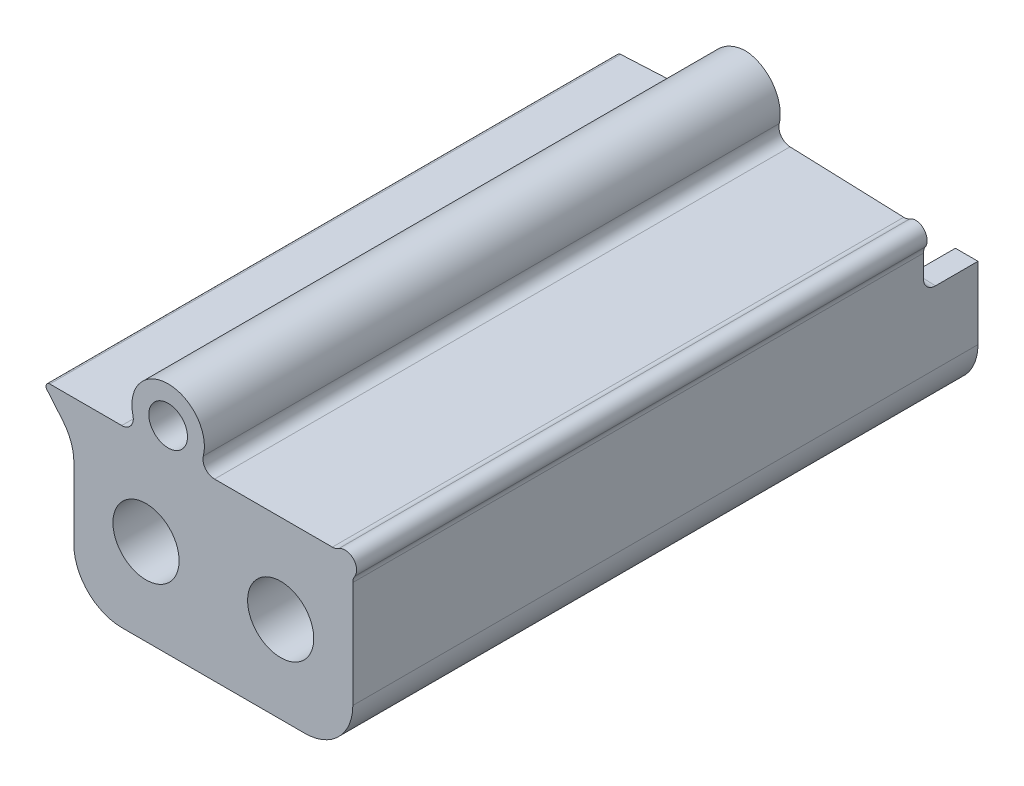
ISO-10303-21;
HEADER;
FILE_DESCRIPTION(('STEP AP214'),'2;1');
FILE_NAME('part.step','',(''),(''),'','','');
FILE_SCHEMA(('AUTOMOTIVE_DESIGN { 1 0 10303 214 1 1 1 1 }'));
ENDSEC;
DATA;
#1=APPLICATION_CONTEXT('core data for automotive mechanical design processes');
#2=APPLICATION_PROTOCOL_DEFINITION('international standard','automotive_design',2000,#1);
#3=PRODUCT_CONTEXT('',#1,'mechanical');
#4=PRODUCT('Part','Part','',(#3));
#5=PRODUCT_RELATED_PRODUCT_CATEGORY('part','',(#4));
#6=PRODUCT_DEFINITION_FORMATION('','',#4);
#7=PRODUCT_DEFINITION_CONTEXT('part definition',#1,'design');
#8=PRODUCT_DEFINITION('design','',#6,#7);
#9=PRODUCT_DEFINITION_SHAPE('','',#8);
#10=(LENGTH_UNIT() NAMED_UNIT(*) SI_UNIT(.MILLI.,.METRE.));
#11=(NAMED_UNIT(*) PLANE_ANGLE_UNIT() SI_UNIT($,.RADIAN.));
#12=(NAMED_UNIT(*) SI_UNIT($,.STERADIAN.) SOLID_ANGLE_UNIT());
#13=UNCERTAINTY_MEASURE_WITH_UNIT(LENGTH_MEASURE(1.E-05),#10,'distance_accuracy_value','');
#14=(GEOMETRIC_REPRESENTATION_CONTEXT(3) GLOBAL_UNCERTAINTY_ASSIGNED_CONTEXT((#13)) GLOBAL_UNIT_ASSIGNED_CONTEXT((#10,
#11,#12)) REPRESENTATION_CONTEXT('',''));
#15=CARTESIAN_POINT('',(0.,0.,0.));
#16=DIRECTION('',(0.,0.,1.));
#17=DIRECTION('',(1.,0.,0.));
#18=AXIS2_PLACEMENT_3D('',#15,#16,#17);
#19=CARTESIAN_POINT('',(-59.9778453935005,-79.883,71.9582));
#20=DIRECTION('',(0.,0.,-1.));
#21=DIRECTION('',(-1.,0.,0.));
#22=AXIS2_PLACEMENT_3D('',#19,#20,#21);
#23=CYLINDRICAL_SURFACE('',#22,1.524);
#24=CARTESIAN_POINT('',(-59.9778453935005,-79.883,-3.48460755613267));
#25=DIRECTION('',(0.0348994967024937,0.,-0.999390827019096));
#26=DIRECTION('',(-0.999390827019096,0.,-0.0348994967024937));
#27=AXIS2_PLACEMENT_3D('',#24,#25,#26);
#28=ELLIPSE('',#27,1.5249289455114,1.524);
#29=CARTESIAN_POINT('',(-59.9778453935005,-81.407,-3.48460755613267));
#30=VERTEX_POINT('',#29);
#31=CARTESIAN_POINT('',(-59.1354226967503,-81.153,-3.45518950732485));
#32=VERTEX_POINT('',#31);
#33=EDGE_CURVE('E687',#30,#32,#28,.F.);
#34=ORIENTED_EDGE('',*,*,#33,.F.);
#35=DIRECTION('',(0.,0.,-1.));
#36=VECTOR('',#35,1.);
#37=CARTESIAN_POINT('',(-59.9778453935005,-81.407,71.9582));
#38=LINE('',#37,#36);
#39=CARTESIAN_POINT('',(-59.9778453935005,-81.407,71.9582));
#40=VERTEX_POINT('',#39);
#41=EDGE_CURVE('E702',#40,#30,#38,.T.);
#42=ORIENTED_EDGE('',*,*,#41,.F.);
#43=CARTESIAN_POINT('',(-59.9778453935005,-79.883,71.9582));
#44=DIRECTION('',(0.,0.,-1.));
#45=DIRECTION('',(1.,0.,0.));
#46=AXIS2_PLACEMENT_3D('',#43,#44,#45);
#47=CIRCLE('',#46,1.524);
#48=CARTESIAN_POINT('',(-59.1354226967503,-81.153,71.9582));
#49=VERTEX_POINT('',#48);
#50=EDGE_CURVE('E870',#49,#40,#47,.T.);
#51=ORIENTED_EDGE('',*,*,#50,.F.);
#52=DIRECTION('',(0.,0.,-1.));
#53=VECTOR('',#52,1.);
#54=CARTESIAN_POINT('',(-59.1354226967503,-81.153,71.9582));
#55=LINE('',#54,#53);
#56=EDGE_CURVE('E704',#49,#32,#55,.T.);
#57=ORIENTED_EDGE('',*,*,#56,.T.);
#58=EDGE_LOOP('',(#34,#42,#51,#57));
#59=FACE_BOUND('',#58,.T.);
#60=ADVANCED_FACE('F57',(#59),#23,.F.);
#61=CARTESIAN_POINT('',(-75.5358464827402,-81.407,71.9582));
#62=DIRECTION('',(0.,-1.,0.));
#63=DIRECTION('',(1.,0.,0.));
#64=AXIS2_PLACEMENT_3D('',#61,#62,#63);
#65=PLANE('',#64);
#66=DIRECTION('',(0.999390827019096,0.,0.0348994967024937));
#67=VECTOR('',#66,1.);
#68=CARTESIAN_POINT('',(-72.885585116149,-81.407,-3.93535575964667));
#69=LINE('',#68,#67);
#70=CARTESIAN_POINT('',(-75.5358464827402,-81.407,-4.02790492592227));
#71=VERTEX_POINT('',#70);
#72=EDGE_CURVE('E370',#71,#30,#69,.T.);
#73=ORIENTED_EDGE('',*,*,#72,.F.);
#74=DIRECTION('',(0.,0.,-1.));
#75=VECTOR('',#74,1.);
#76=CARTESIAN_POINT('',(-75.5358464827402,-81.407,71.9582));
#77=LINE('',#76,#75);
#78=CARTESIAN_POINT('',(-75.5358464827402,-81.407,71.9582));
#79=VERTEX_POINT('',#78);
#80=EDGE_CURVE('E710',#79,#71,#77,.T.);
#81=ORIENTED_EDGE('',*,*,#80,.F.);
#82=DIRECTION('',(-1.,0.,0.));
#83=VECTOR('',#82,1.);
#84=CARTESIAN_POINT('',(-75.5358464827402,-81.407,71.9582));
#85=LINE('',#84,#83);
#86=EDGE_CURVE('E706',#40,#79,#85,.T.);
#87=ORIENTED_EDGE('',*,*,#86,.F.);
#88=ORIENTED_EDGE('',*,*,#41,.T.);
#89=EDGE_LOOP('',(#73,#81,#87,#88));
#90=FACE_BOUND('',#89,.T.);
#91=ADVANCED_FACE('F705',(#90),#65,.F.);
#92=CARTESIAN_POINT('',(-75.5358464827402,-79.883,71.9582));
#93=DIRECTION('',(0.,0.,-1.));
#94=DIRECTION('',(-1.,0.,0.));
#95=AXIS2_PLACEMENT_3D('',#92,#93,#94);
#96=CYLINDRICAL_SURFACE('',#95,1.524);
#97=CARTESIAN_POINT('',(-75.5358464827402,-79.883,-4.02790492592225));
#98=DIRECTION('',(0.0348994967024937,0.,-0.999390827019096));
#99=DIRECTION('',(-0.999390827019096,0.,-0.0348994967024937));
#100=AXIS2_PLACEMENT_3D('',#97,#98,#99);
#101=ELLIPSE('',#100,1.52492894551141,1.524);
#102=CARTESIAN_POINT('',(-77.0147567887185,-79.515032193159,-4.07954961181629));
#103=VERTEX_POINT('',#102);
#104=EDGE_CURVE('E366',#103,#71,#101,.F.);
#105=ORIENTED_EDGE('',*,*,#104,.F.);
#106=DIRECTION('',(0.,0.,-1.));
#107=VECTOR('',#106,1.);
#108=CARTESIAN_POINT('',(-77.0147567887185,-79.515032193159,71.9582));
#109=LINE('',#108,#107);
#110=CARTESIAN_POINT('',(-77.0147567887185,-79.515032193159,71.9582));
#111=VERTEX_POINT('',#110);
#112=EDGE_CURVE('E364',#111,#103,#109,.T.);
#113=ORIENTED_EDGE('',*,*,#112,.F.);
#114=CARTESIAN_POINT('',(-75.5358464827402,-79.883,71.9582));
#115=DIRECTION('',(0.,0.,-1.));
#116=DIRECTION('',(-1.,0.,0.));
#117=AXIS2_PLACEMENT_3D('',#114,#115,#116);
#118=CIRCLE('',#117,1.524);
#119=EDGE_CURVE('E889',#79,#111,#118,.T.);
#120=ORIENTED_EDGE('',*,*,#119,.F.);
#121=ORIENTED_EDGE('',*,*,#80,.T.);
#122=EDGE_LOOP('',(#105,#113,#120,#121));
#123=FACE_BOUND('',#122,.T.);
#124=ADVANCED_FACE('F1216',(#123),#96,.F.);
#125=CARTESIAN_POINT('',(-81.661,-78.359,71.9582));
#126=DIRECTION('',(0.,0.,-1.));
#127=DIRECTION('',(-1.,0.,0.));
#128=AXIS2_PLACEMENT_3D('',#125,#126,#127);
#129=CYLINDRICAL_SURFACE('',#128,4.78789999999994);
#130=CARTESIAN_POINT('',(-81.661,-78.359,-4.24180000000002));
#131=DIRECTION('',(-0.0523359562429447,0.,-0.998629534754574));
#132=DIRECTION('',(0.998629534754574,0.,-0.0523359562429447));
#133=AXIS2_PLACEMENT_3D('',#130,#131,#132);
#134=ELLIPSE('',#133,4.79447065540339,4.78789999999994);
#135=CARTESIAN_POINT('',(-86.3072432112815,-79.515032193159,-3.99830071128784));
#136=VERTEX_POINT('',#135);
#137=CARTESIAN_POINT('',(-81.6831493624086,-73.5711512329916,-4.24063920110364));
#138=VERTEX_POINT('',#137);
#139=EDGE_CURVE('E731',#136,#138,#134,.T.);
#140=ORIENTED_EDGE('',*,*,#139,.F.);
#141=DIRECTION('',(0.,0.,-1.));
#142=VECTOR('',#141,1.);
#143=CARTESIAN_POINT('',(-86.3072432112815,-79.515032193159,71.9582));
#144=LINE('',#143,#142);
#145=CARTESIAN_POINT('',(-86.3072432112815,-79.515032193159,71.9582));
#146=VERTEX_POINT('',#145);
#147=EDGE_CURVE('E976',#146,#136,#144,.T.);
#148=ORIENTED_EDGE('',*,*,#147,.F.);
#149=CARTESIAN_POINT('',(-81.661,-78.359,71.9582));
#150=DIRECTION('',(0.,0.,1.));
#151=DIRECTION('',(1.,0.,0.));
#152=AXIS2_PLACEMENT_3D('',#149,#150,#151);
#153=CIRCLE('',#152,4.78789999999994);
#154=EDGE_CURVE('E892',#111,#146,#153,.T.);
#155=ORIENTED_EDGE('',*,*,#154,.F.);
#156=ORIENTED_EDGE('',*,*,#112,.T.);
#157=CARTESIAN_POINT('',(-81.661,-78.359,-4.24180000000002));
#158=DIRECTION('',(0.0348994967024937,0.,-0.999390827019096));
#159=DIRECTION('',(-0.999390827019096,0.,-0.0348994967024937));
#160=AXIS2_PLACEMENT_3D('',#157,#158,#159);
#161=ELLIPSE('',#160,4.79081843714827,4.78789999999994);
#162=CARTESIAN_POINT('',(-81.6388337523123,-73.5711513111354,-4.24102593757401));
#163=VERTEX_POINT('',#162);
#164=EDGE_CURVE('E348',#163,#103,#161,.T.);
#165=ORIENTED_EDGE('',*,*,#164,.F.);
#166=CARTESIAN_POINT('',(-81.6831493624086,-73.5711512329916,-4.24063920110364));
#167=CARTESIAN_POINT('',(-81.6757662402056,-73.5711170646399,-4.24102598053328));
#168=CARTESIAN_POINT('',(-81.668381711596,-73.5710999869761,-4.24125159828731));
#169=CARTESIAN_POINT('',(-81.6536098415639,-73.5711000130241,-4.2413805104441));
#170=CARTESIAN_POINT('',(-81.6462225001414,-73.5711171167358,-4.24128380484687));
#171=CARTESIAN_POINT('',(-81.6388337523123,-73.5711513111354,-4.24102593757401));
#172=B_SPLINE_CURVE_WITH_KNOTS('',3,(#166,#167,#168,#169,#170,#171),.UNSPECIFIED.,.F.,.F.,(4,2,
4),(0.,0.0221639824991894,0.0443279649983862),.UNSPECIFIED.);
#173=EDGE_CURVE('E336',#138,#163,#172,.T.);
#174=ORIENTED_EDGE('',*,*,#173,.F.);
#175=EDGE_LOOP('',(#140,#148,#155,#156,#165,#174));
#176=FACE_BOUND('',#175,.T.);
#177=ADVANCED_FACE('F361',(#176),#129,.T.);
#178=CARTESIAN_POINT('',(-87.7861535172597,-79.883,71.9582));
#179=DIRECTION('',(0.,0.,-1.));
#180=DIRECTION('',(-1.,0.,0.));
#181=AXIS2_PLACEMENT_3D('',#178,#179,#180);
#182=CYLINDRICAL_SURFACE('',#181,1.524);
#183=CARTESIAN_POINT('',(-87.7861535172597,-79.883,-3.92079430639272));
#184=DIRECTION('',(-0.0523359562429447,0.,-0.998629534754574));
#185=DIRECTION('',(0.998629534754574,0.,-0.0523359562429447));
#186=AXIS2_PLACEMENT_3D('',#183,#184,#185);
#187=ELLIPSE('',#186,1.52609145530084,1.524);
#188=CARTESIAN_POINT('',(-87.7861535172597,-81.407,-3.92079430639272));
#189=VERTEX_POINT('',#188);
#190=EDGE_CURVE('E742',#189,#136,#187,.F.);
#191=ORIENTED_EDGE('',*,*,#190,.F.);
#192=DIRECTION('',(0.,0.,-1.));
#193=VECTOR('',#192,1.);
#194=CARTESIAN_POINT('',(-87.7861535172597,-81.407,71.9582));
#195=LINE('',#194,#193);
#196=CARTESIAN_POINT('',(-87.7861535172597,-81.407,71.9582));
#197=VERTEX_POINT('',#196);
#198=EDGE_CURVE('E972',#197,#189,#195,.T.);
#199=ORIENTED_EDGE('',*,*,#198,.F.);
#200=CARTESIAN_POINT('',(-87.7861535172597,-79.883,71.9582));
#201=DIRECTION('',(0.,0.,-1.));
#202=DIRECTION('',(1.,0.,0.));
#203=AXIS2_PLACEMENT_3D('',#200,#201,#202);
#204=CIRCLE('',#203,1.524);
#205=EDGE_CURVE('E895',#146,#197,#204,.T.);
#206=ORIENTED_EDGE('',*,*,#205,.F.);
#207=ORIENTED_EDGE('',*,*,#147,.T.);
#208=EDGE_LOOP('',(#191,#199,#206,#207));
#209=FACE_BOUND('',#208,.T.);
#210=ADVANCED_FACE('F1224',(#209),#182,.F.);
#211=CARTESIAN_POINT('',(-97.282,-81.407,71.9582));
#212=DIRECTION('',(0.,-1.,0.));
#213=DIRECTION('',(0.,0.,-1.));
#214=AXIS2_PLACEMENT_3D('',#211,#212,#213);
#215=PLANE('',#214);
#216=DIRECTION('',(0.998629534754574,0.,-0.0523359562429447));
#217=VECTOR('',#216,1.);
#218=CARTESIAN_POINT('',(-101.221747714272,-81.407,-3.2166646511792));
#219=LINE('',#218,#217);
#220=CARTESIAN_POINT('',(-97.282,-81.407,-3.42313807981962));
#221=VERTEX_POINT('',#220);
#222=EDGE_CURVE('E753',#221,#189,#219,.T.);
#223=ORIENTED_EDGE('',*,*,#222,.F.);
#224=DIRECTION('',(0.,0.,-1.));
#225=VECTOR('',#224,1.);
#226=CARTESIAN_POINT('',(-97.282,-81.407,71.9582));
#227=LINE('',#226,#225);
#228=CARTESIAN_POINT('',(-97.282,-81.407,71.9582));
#229=VERTEX_POINT('',#228);
#230=EDGE_CURVE('E968',#229,#221,#227,.T.);
#231=ORIENTED_EDGE('',*,*,#230,.F.);
#232=DIRECTION('',(-1.,0.,0.));
#233=VECTOR('',#232,1.);
#234=CARTESIAN_POINT('',(-97.282,-81.407,71.9582));
#235=LINE('',#234,#233);
#236=EDGE_CURVE('E898',#197,#229,#235,.T.);
#237=ORIENTED_EDGE('',*,*,#236,.F.);
#238=ORIENTED_EDGE('',*,*,#198,.T.);
#239=EDGE_LOOP('',(#223,#231,#237,#238));
#240=FACE_BOUND('',#239,.T.);
#241=ADVANCED_FACE('F1233',(#240),#215,.F.);
#242=CARTESIAN_POINT('',(-97.282,-81.915,71.9582));
#243=DIRECTION('',(0.,0.,-1.));
#244=DIRECTION('',(-1.,0.,0.));
#245=AXIS2_PLACEMENT_3D('',#242,#243,#244);
#246=CYLINDRICAL_SURFACE('',#245,0.507999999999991);
#247=CARTESIAN_POINT('',(-97.282,-81.915,-3.42313807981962));
#248=DIRECTION('',(-0.0523359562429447,0.,-0.998629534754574));
#249=DIRECTION('',(0.998629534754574,0.,-0.0523359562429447));
#250=AXIS2_PLACEMENT_3D('',#247,#248,#249);
#251=ELLIPSE('',#250,0.508697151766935,0.507999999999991);
#252=CARTESIAN_POINT('',(-97.6711505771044,-82.2415361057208,-3.40274356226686));
#253=VERTEX_POINT('',#252);
#254=EDGE_CURVE('E1240',#253,#221,#251,.T.);
#255=ORIENTED_EDGE('',*,*,#254,.F.);
#256=DIRECTION('',(0.,0.,-1.));
#257=VECTOR('',#256,1.);
#258=CARTESIAN_POINT('',(-97.6711505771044,-82.2415361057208,71.9582));
#259=LINE('',#258,#257);
#260=CARTESIAN_POINT('',(-97.6711505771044,-82.2415361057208,71.9582));
#261=VERTEX_POINT('',#260);
#262=EDGE_CURVE('E964',#261,#253,#259,.T.);
#263=ORIENTED_EDGE('',*,*,#262,.F.);
#264=CARTESIAN_POINT('',(-97.282,-81.915,71.9582));
#265=DIRECTION('',(0.,0.,1.));
#266=DIRECTION('',(1.,0.,0.));
#267=AXIS2_PLACEMENT_3D('',#264,#265,#266);
#268=CIRCLE('',#267,0.507999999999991);
#269=EDGE_CURVE('E901',#229,#261,#268,.T.);
#270=ORIENTED_EDGE('',*,*,#269,.F.);
#271=ORIENTED_EDGE('',*,*,#230,.T.);
#272=EDGE_LOOP('',(#255,#263,#270,#271));
#273=FACE_BOUND('',#272,.T.);
#274=ADVANCED_FACE('F1239',(#273),#246,.T.);
#275=CARTESIAN_POINT('',(-95.5926177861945,-84.7186350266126,71.9582));
#276=DIRECTION('',(0.76604444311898,0.642787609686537,0.));
#277=DIRECTION('',(-0.642787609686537,0.76604444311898,0.));
#278=AXIS2_PLACEMENT_3D('',#275,#276,#277);
#279=PLANE('',#278);
#280=DIRECTION('',(-0.642423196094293,0.765610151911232,0.0336679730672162));
#281=VECTOR('',#280,1.);
#282=CARTESIAN_POINT('',(-97.2249622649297,-82.7732826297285,-3.42612730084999));
#283=LINE('',#282,#281);
#284=CARTESIAN_POINT('',(-95.5926177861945,-84.7186350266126,-3.51167485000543));
#285=VERTEX_POINT('',#284);
#286=EDGE_CURVE('E1244',#285,#253,#283,.T.);
#287=ORIENTED_EDGE('',*,*,#286,.F.);
#288=DIRECTION('',(0.,0.,-1.));
#289=VECTOR('',#288,1.);
#290=CARTESIAN_POINT('',(-95.5926177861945,-84.7186350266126,71.9582));
#291=LINE('',#290,#289);
#292=CARTESIAN_POINT('',(-95.5926177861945,-84.7186350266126,71.9582));
#293=VERTEX_POINT('',#292);
#294=EDGE_CURVE('E960',#293,#285,#291,.T.);
#295=ORIENTED_EDGE('',*,*,#294,.F.);
#296=DIRECTION('',(0.642787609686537,-0.76604444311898,0.));
#297=VECTOR('',#296,1.);
#298=CARTESIAN_POINT('',(-95.5926177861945,-84.7186350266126,71.9582));
#299=LINE('',#298,#297);
#300=EDGE_CURVE('E904',#261,#293,#299,.T.);
#301=ORIENTED_EDGE('',*,*,#300,.F.);
#302=ORIENTED_EDGE('',*,*,#262,.T.);
#303=EDGE_LOOP('',(#287,#295,#301,#302));
#304=FACE_BOUND('',#303,.T.);
#305=ADVANCED_FACE('F643',(#304),#279,.F.);
#306=CARTESIAN_POINT('',(-100.457,-88.8003363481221,71.9582));
#307=DIRECTION('',(0.,0.,-1.));
#308=DIRECTION('',(-1.,0.,0.));
#309=AXIS2_PLACEMENT_3D('',#306,#307,#308);
#310=CYLINDRICAL_SURFACE('',#309,6.35000000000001);
#311=CARTESIAN_POINT('',(-100.457,-88.8003363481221,-3.25674338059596));
#312=DIRECTION('',(-0.0523359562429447,0.,-0.998629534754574));
#313=DIRECTION('',(0.998629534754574,0.,-0.0523359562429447));
#314=AXIS2_PLACEMENT_3D('',#311,#312,#313);
#315=ELLIPSE('',#314,6.35871439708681,6.35000000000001);
#316=CARTESIAN_POINT('',(-94.3505684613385,-87.0584999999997,-3.57676789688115));
#317=VERTEX_POINT('',#316);
#318=EDGE_CURVE('E1504',#317,#285,#315,.F.);
#319=ORIENTED_EDGE('',*,*,#318,.F.);
#320=CARTESIAN_POINT('',(-94.3505684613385,-87.0584999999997,-3.57676789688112));
#321=CARTESIAN_POINT('',(-94.3380503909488,-87.1023763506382,-3.57742451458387));
#322=CARTESIAN_POINT('',(-94.326022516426,-87.1463469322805,-3.57987724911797));
#323=CARTESIAN_POINT('',(-94.3029922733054,-87.2342111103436,-3.5884112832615));
#324=CARTESIAN_POINT('',(-94.2919900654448,-87.2781046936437,-3.59449315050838));
#325=CARTESIAN_POINT('',(-94.260614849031,-87.4091692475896,-3.61822103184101));
#326=CARTESIAN_POINT('',(-94.2418496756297,-87.4958070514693,-3.64135042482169));
#327=CARTESIAN_POINT('',(-94.2087417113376,-87.6648972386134,-3.70200733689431));
#328=CARTESIAN_POINT('',(-94.1944056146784,-87.7473431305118,-3.73955646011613));
#329=CARTESIAN_POINT('',(-94.1698971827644,-87.9052278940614,-3.82821052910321));
#330=CARTESIAN_POINT('',(-94.1597223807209,-87.9806708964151,-3.87930741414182));
#331=CARTESIAN_POINT('',(-94.1430921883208,-88.1206674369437,-3.99254580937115));
#332=CARTESIAN_POINT('',(-94.1365658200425,-88.1854101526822,-4.0544433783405));
#333=CARTESIAN_POINT('',(-94.1261615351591,-88.303821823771,-4.18828315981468));
#334=CARTESIAN_POINT('',(-94.1222844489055,-88.3574873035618,-4.26022851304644));
#335=CARTESIAN_POINT('',(-94.1163871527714,-88.4519522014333,-4.41191722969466));
#336=CARTESIAN_POINT('',(-94.1143621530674,-88.492784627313,-4.49163988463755));
#337=CARTESIAN_POINT('',(-94.1114380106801,-88.5605445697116,-4.65678361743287));
#338=CARTESIAN_POINT('',(-94.1105381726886,-88.5874806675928,-4.7422011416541));
#339=CARTESIAN_POINT('',(-94.1095477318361,-88.62001274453,-4.88662716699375));
#340=CARTESIAN_POINT('',(-94.1092859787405,-88.6297510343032,-4.94473539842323));
#341=CARTESIAN_POINT('',(-94.1089549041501,-88.6427440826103,-5.06159197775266));
#342=CARTESIAN_POINT('',(-94.10888531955,-88.6460077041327,-5.12033933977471));
#343=CARTESIAN_POINT('',(-94.108875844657,-88.6459999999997,-5.1791130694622));
#344=B_SPLINE_CURVE_WITH_KNOTS('',3,(#320,#321,#322,#323,#324,#325,#326,#327,#328,#329,#330,
#331,#332,#333,#334,#335,#336,#337,#338,#339,#340,#341,#342,#343),.UNSPECIFIED.,.F.,.F.,(4,2,2,
2,2,2,2,2,2,2,2,4),(0.,0.136819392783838,0.273660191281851,0.547086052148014,0.820923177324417,
1.09459773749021,1.36274427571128,1.63097481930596,1.89850969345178,2.16587915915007,
2.34230021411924,2.51847960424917),.UNSPECIFIED.);
#345=CARTESIAN_POINT('',(-94.108875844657,-88.6459999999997,-5.1791130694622));
#346=VERTEX_POINT('',#345);
#347=EDGE_CURVE('E11',#317,#346,#344,.T.);
#348=ORIENTED_EDGE('',*,*,#347,.T.);
#349=DIRECTION('',(0.,0.,-1.));
#350=VECTOR('',#349,1.);
#351=CARTESIAN_POINT('',(-94.108875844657,-88.6459999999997,71.9582));
#352=LINE('',#351,#350);
#353=CARTESIAN_POINT('',(-94.108875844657,-88.6459999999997,-10.5918));
#354=VERTEX_POINT('',#353);
#355=EDGE_CURVE('E863',#346,#354,#352,.T.);
#356=ORIENTED_EDGE('',*,*,#355,.T.);
#357=CARTESIAN_POINT('',(-100.457,-88.8003363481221,-10.5918));
#358=DIRECTION('',(0.,0.,-1.));
#359=DIRECTION('',(-1.,0.,0.));
#360=AXIS2_PLACEMENT_3D('',#357,#358,#359);
#361=CIRCLE('',#360,6.35000000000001);
#362=CARTESIAN_POINT('',(-94.107,-88.8003363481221,-10.5918));
#363=VERTEX_POINT('',#362);
#364=EDGE_CURVE('E867',#354,#363,#361,.T.);
#365=ORIENTED_EDGE('',*,*,#364,.T.);
#366=DIRECTION('',(0.,0.,-1.));
#367=VECTOR('',#366,1.);
#368=CARTESIAN_POINT('',(-94.107,-88.8003363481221,71.9582));
#369=LINE('',#368,#367);
#370=CARTESIAN_POINT('',(-94.107,-88.8003363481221,71.9582));
#371=VERTEX_POINT('',#370);
#372=EDGE_CURVE('E956',#371,#363,#369,.T.);
#373=ORIENTED_EDGE('',*,*,#372,.F.);
#374=CARTESIAN_POINT('',(-100.457,-88.8003363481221,71.9582));
#375=DIRECTION('',(0.,0.,-1.));
#376=DIRECTION('',(1.,0.,0.));
#377=AXIS2_PLACEMENT_3D('',#374,#375,#376);
#378=CIRCLE('',#377,6.35000000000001);
#379=EDGE_CURVE('E907',#293,#371,#378,.T.);
#380=ORIENTED_EDGE('',*,*,#379,.F.);
#381=ORIENTED_EDGE('',*,*,#294,.T.);
#382=EDGE_LOOP('',(#319,#348,#356,#365,#373,#380,#381));
#383=FACE_BOUND('',#382,.T.);
#384=ADVANCED_FACE('F623',(#383),#310,.F.);
#385=CARTESIAN_POINT('',(-57.277,-84.1078453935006,71.9582));
#386=DIRECTION('',(-1.,0.,0.));
#387=DIRECTION('',(0.,-1.,0.));
#388=AXIS2_PLACEMENT_3D('',#385,#386,#387);
#389=PLANE('',#388);
#390=DIRECTION('',(0.,-1.,0.));
#391=VECTOR('',#390,1.);
#392=CARTESIAN_POINT('',(-57.277,-84.1078453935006,-3.39029195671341));
#393=LINE('',#392,#391);
#394=CARTESIAN_POINT('',(-57.277,-84.1078453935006,-3.39029195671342));
#395=VERTEX_POINT('',#394);
#396=CARTESIAN_POINT('',(-57.277,-87.0584999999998,-3.39029195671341));
#397=VERTEX_POINT('',#396);
#398=EDGE_CURVE('E684',#395,#397,#393,.T.);
#399=ORIENTED_EDGE('',*,*,#398,.F.);
#400=DIRECTION('',(0.,0.,-1.));
#401=VECTOR('',#400,1.);
#402=CARTESIAN_POINT('',(-57.277,-84.1078453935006,71.9582));
#403=LINE('',#402,#401);
#404=CARTESIAN_POINT('',(-57.277,-84.1078453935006,71.9582));
#405=VERTEX_POINT('',#404);
#406=EDGE_CURVE('E937',#405,#395,#403,.T.);
#407=ORIENTED_EDGE('',*,*,#406,.F.);
#408=DIRECTION('',(0.,1.,0.));
#409=VECTOR('',#408,1.);
#410=CARTESIAN_POINT('',(-57.277,-84.1078453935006,71.9582));
#411=LINE('',#410,#409);
#412=CARTESIAN_POINT('',(-57.277,-98.171,71.9582));
#413=VERTEX_POINT('',#412);
#414=EDGE_CURVE('E922',#413,#405,#411,.T.);
#415=ORIENTED_EDGE('',*,*,#414,.F.);
#416=DIRECTION('',(0.,0.,-1.));
#417=VECTOR('',#416,1.);
#418=CARTESIAN_POINT('',(-57.277,-98.171,71.9582));
#419=LINE('',#418,#417);
#420=CARTESIAN_POINT('',(-57.277,-98.171,-10.5918));
#421=VERTEX_POINT('',#420);
#422=EDGE_CURVE('E941',#413,#421,#419,.T.);
#423=ORIENTED_EDGE('',*,*,#422,.T.);
#424=DIRECTION('',(0.,1.,0.));
#425=VECTOR('',#424,1.);
#426=CARTESIAN_POINT('',(-57.277,-79.883,-10.5918));
#427=LINE('',#426,#425);
#428=CARTESIAN_POINT('',(-57.277,-88.6459999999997,-10.5918));
#429=VERTEX_POINT('',#428);
#430=EDGE_CURVE('E866',#421,#429,#427,.T.);
#431=ORIENTED_EDGE('',*,*,#430,.T.);
#432=DIRECTION('',(0.,0.,1.));
#433=VECTOR('',#432,1.);
#434=CARTESIAN_POINT('',(-57.277,-88.6459999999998,71.9582));
#435=LINE('',#434,#433);
#436=CARTESIAN_POINT('',(-57.277,-88.6459999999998,-4.97875960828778));
#437=VERTEX_POINT('',#436);
#438=EDGE_CURVE('E859',#429,#437,#435,.T.);
#439=ORIENTED_EDGE('',*,*,#438,.T.);
#440=CARTESIAN_POINT('',(-57.277,-87.0584999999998,-4.97875960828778));
#441=DIRECTION('',(-1.,0.,0.));
#442=DIRECTION('',(0.,0.,1.));
#443=AXIS2_PLACEMENT_3D('',#440,#441,#442);
#444=ELLIPSE('',#443,1.58846765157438,1.5875);
#445=EDGE_CURVE('E567',#437,#397,#444,.T.);
#446=ORIENTED_EDGE('',*,*,#445,.T.);
#447=EDGE_LOOP('',(#399,#407,#415,#423,#431,#439,#446));
#448=FACE_BOUND('',#447,.T.);
#449=ADVANCED_FACE('F619',(#448),#389,.F.);
#450=CARTESIAN_POINT('',(-55.753,-84.1078453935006,71.9582));
#451=DIRECTION('',(0.,0.,-1.));
#452=DIRECTION('',(-1.,0.,0.));
#453=AXIS2_PLACEMENT_3D('',#450,#451,#452);
#454=CYLINDRICAL_SURFACE('',#453,1.524);
#455=CARTESIAN_POINT('',(-55.753,-84.1078453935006,-3.337072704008));
#456=DIRECTION('',(0.0348994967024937,0.,-0.999390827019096));
#457=DIRECTION('',(-0.999390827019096,0.,-0.0348994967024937));
#458=AXIS2_PLACEMENT_3D('',#455,#456,#457);
#459=ELLIPSE('',#458,1.52492894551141,1.524);
#460=CARTESIAN_POINT('',(-57.023,-83.2654226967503,-3.38142208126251));
#461=VERTEX_POINT('',#460);
#462=EDGE_CURVE('E681',#461,#395,#459,.F.);
#463=ORIENTED_EDGE('',*,*,#462,.F.);
#464=DIRECTION('',(0.,0.,-1.));
#465=VECTOR('',#464,1.);
#466=CARTESIAN_POINT('',(-57.023,-83.2654226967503,71.9582));
#467=LINE('',#466,#465);
#468=CARTESIAN_POINT('',(-57.023,-83.2654226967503,71.9582));
#469=VERTEX_POINT('',#468);
#470=EDGE_CURVE('E933',#469,#461,#467,.T.);
#471=ORIENTED_EDGE('',*,*,#470,.F.);
#472=CARTESIAN_POINT('',(-55.753,-84.1078453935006,71.9582));
#473=DIRECTION('',(0.,0.,-1.));
#474=DIRECTION('',(1.,0.,0.));
#475=AXIS2_PLACEMENT_3D('',#472,#473,#474);
#476=CIRCLE('',#475,1.524);
#477=EDGE_CURVE('E925',#405,#469,#476,.T.);
#478=ORIENTED_EDGE('',*,*,#477,.F.);
#479=ORIENTED_EDGE('',*,*,#406,.T.);
#480=EDGE_LOOP('',(#463,#471,#478,#479));
#481=FACE_BOUND('',#480,.T.);
#482=ADVANCED_FACE('F615',(#481),#454,.F.);
#483=CARTESIAN_POINT('',(-58.293,-82.423,71.9582));
#484=DIRECTION('',(0.,0.,-1.));
#485=DIRECTION('',(-1.,0.,0.));
#486=AXIS2_PLACEMENT_3D('',#483,#484,#485);
#487=CYLINDRICAL_SURFACE('',#486,1.524);
#488=ORIENTED_EDGE('',*,*,#470,.T.);
#489=CARTESIAN_POINT('',(-58.293,-82.423,-3.42577145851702));
#490=DIRECTION('',(0.0348994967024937,0.,-0.999390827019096));
#491=DIRECTION('',(-0.999390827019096,0.,-0.0348994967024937));
#492=AXIS2_PLACEMENT_3D('',#489,#490,#491);
#493=ELLIPSE('',#492,1.5249289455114,1.524);
#494=EDGE_CURVE('E678',#32,#461,#493,.T.);
#495=ORIENTED_EDGE('',*,*,#494,.F.);
#496=ORIENTED_EDGE('',*,*,#56,.F.);
#497=CARTESIAN_POINT('',(-58.293,-82.423,71.9582));
#498=DIRECTION('',(0.,0.,1.));
#499=DIRECTION('',(-1.,0.,0.));
#500=AXIS2_PLACEMENT_3D('',#497,#498,#499);
#501=CIRCLE('',#500,1.524);
#502=EDGE_CURVE('E928',#469,#49,#501,.T.);
#503=ORIENTED_EDGE('',*,*,#502,.F.);
#504=EDGE_LOOP('',(#488,#495,#496,#503));
#505=FACE_BOUND('',#504,.T.);
#506=ADVANCED_FACE('F612',(#505),#487,.T.);
#507=CARTESIAN_POINT('',(912.243,-87.8522500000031,-4.2418));
#508=DIRECTION('',(0.,0.,1.));
#509=DIRECTION('',(0.,-1.,0.));
#510=AXIS2_PLACEMENT_3D('',#507,#508,#509);
#511=PLANE('',#510);
#512=CARTESIAN_POINT('',(-84.582,-93.091,-4.2418));
#513=DIRECTION('',(0.,0.,1.));
#514=DIRECTION('',(0.,-1.,0.));
#515=AXIS2_PLACEMENT_3D('',#512,#513,#514);
#516=CIRCLE('',#515,6.5405);
#517=CARTESIAN_POINT('',(-88.786178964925,-88.0807086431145,-4.2418));
#518=VERTEX_POINT('',#517);
#519=CARTESIAN_POINT('',(-90.6144999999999,-90.5637319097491,-4.2418));
#520=VERTEX_POINT('',#519);
#521=EDGE_CURVE('E76',#518,#520,#516,.T.);
#522=ORIENTED_EDGE('',*,*,#521,.T.);
#523=DIRECTION('',(0.,1.,0.));
#524=VECTOR('',#523,1.);
#525=CARTESIAN_POINT('',(-90.6144999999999,-88.6459999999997,-4.2418));
#526=LINE('',#525,#524);
#527=CARTESIAN_POINT('',(-90.6144999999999,-88.1846423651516,-4.2418));
#528=VERTEX_POINT('',#527);
#529=EDGE_CURVE('E82',#520,#528,#526,.T.);
#530=ORIENTED_EDGE('',*,*,#529,.T.);
#531=CARTESIAN_POINT('',(-111.993874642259,-87.0584999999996,-4.2418));
#532=DIRECTION('',(0.,0.,1.));
#533=DIRECTION('',(1.,0.,0.));
#534=AXIS2_PLACEMENT_3D('',#531,#532,#533);
#535=ELLIPSE('',#534,30.3328746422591,1.5875);
#536=EDGE_CURVE('E1052',#528,#518,#535,.T.);
#537=ORIENTED_EDGE('',*,*,#536,.T.);
#538=EDGE_LOOP('',(#522,#530,#537));
#539=FACE_BOUND('',#538,.T.);
#540=ADVANCED_FACE('F599',(#539),#511,.F.);
#541=CARTESIAN_POINT('',(-81.6388067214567,-87.1080837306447,-4.2418));
#542=CARTESIAN_POINT('',(-81.640822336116,-87.1059122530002,-4.2418));
#543=CARTESIAN_POINT('',(-81.6429082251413,-87.1037149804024,-4.2418));
#544=CARTESIAN_POINT('',(-81.6461796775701,-87.1010297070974,-4.2418));
#545=CARTESIAN_POINT('',(-81.6471755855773,-87.1002951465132,-4.2418));
#546=CARTESIAN_POINT('',(-81.6492598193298,-87.0989784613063,-4.2418));
#547=CARTESIAN_POINT('',(-81.6503473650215,-87.0983951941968,-4.2418));
#548=CARTESIAN_POINT('',(-81.6521805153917,-87.0976587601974,-4.2418));
#549=CARTESIAN_POINT('',(-81.6528937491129,-87.0974265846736,-4.2418));
#550=CARTESIAN_POINT('',(-81.6543488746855,-87.0970821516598,-4.2418));
#551=CARTESIAN_POINT('',(-81.6550907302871,-87.0969697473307,-4.2418));
#552=CARTESIAN_POINT('',(-81.6565867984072,-87.0968816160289,-4.2418));
#553=CARTESIAN_POINT('',(-81.6573410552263,-87.0969066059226,-4.2418));
#554=CARTESIAN_POINT('',(-81.658832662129,-87.0970907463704,-4.2418));
#555=CARTESIAN_POINT('',(-81.6595700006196,-87.0972499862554,-4.2418));
#556=CARTESIAN_POINT('',(-81.6612533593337,-87.097752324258,-4.2418));
#557=CARTESIAN_POINT('',(-81.6621859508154,-87.0981393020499,-4.2418));
#558=CARTESIAN_POINT('',(-81.663981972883,-87.0990511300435,-4.2418));
#559=CARTESIAN_POINT('',(-81.6648451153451,-87.0995765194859,-4.2418));
#560=CARTESIAN_POINT('',(-81.6680359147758,-87.1017499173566,-4.2418));
#561=CARTESIAN_POINT('',(-81.670154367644,-87.1036934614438,-4.2418));
#562=CARTESIAN_POINT('',(-81.6741600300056,-87.1078309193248,-4.2418));
#563=CARTESIAN_POINT('',(-81.6760433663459,-87.1100281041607,-4.2418));
#564=CARTESIAN_POINT('',(-81.6865641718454,-87.1229356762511,-4.2418));
#565=CARTESIAN_POINT('',(-81.6939838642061,-87.1346063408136,-4.2418));
#566=CARTESIAN_POINT('',(-81.7045985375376,-87.1515479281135,-4.2418));
#567=CARTESIAN_POINT('',(-81.7078748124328,-87.1568118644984,-4.2418));
#568=CARTESIAN_POINT('',(-81.7143582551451,-87.1673496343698,-4.2418));
#569=CARTESIAN_POINT('',(-81.7175656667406,-87.1726233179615,-4.2418));
#570=CARTESIAN_POINT('',(-81.7207395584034,-87.1779284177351,-4.2418));
#571=B_SPLINE_CURVE_WITH_KNOTS('',3,(#541,#542,#543,#544,#545,#546,#547,#548,#549,#550,#551,
#552,#553,#554,#555,#556,#557,#558,#559,#560,#561,#562,#563,#564,#565,#566,#567,#568,#569,#570),
.UNSPECIFIED.,.F.,.F.,(4,2,2,2,2,2,2,2,2,2,2,2,2,2,4),(0.,0.0089701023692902,0.0126781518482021,
0.0163573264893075,0.0185993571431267,0.0208386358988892,0.0230896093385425,0.0253420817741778,
0.0283537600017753,0.0313773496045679,0.0399317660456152,0.0486124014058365,0.0899175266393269,
0.108527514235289,0.127054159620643),.UNSPECIFIED.);
#572=CARTESIAN_POINT('',(-81.6832101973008,-87.1192391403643,-4.2418));
#573=VERTEX_POINT('',#572);
#574=CARTESIAN_POINT('',(-81.6388067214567,-87.1080837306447,-4.2418));
#575=VERTEX_POINT('',#574);
#576=EDGE_CURVE('E586',#573,#575,#571,.F.);
#577=ORIENTED_EDGE('',*,*,#576,.T.);
#578=CARTESIAN_POINT('',(-36.1732379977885,-87.0584999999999,-4.2418));
#579=DIRECTION('',(0.,0.,1.));
#580=DIRECTION('',(1.,0.,0.));
#581=AXIS2_PLACEMENT_3D('',#578,#579,#580);
#582=ELLIPSE('',#581,45.4877620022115,1.5875);
#583=CARTESIAN_POINT('',(-78.5494999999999,-87.6355449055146,-4.2418));
#584=VERTEX_POINT('',#583);
#585=EDGE_CURVE('E498',#575,#584,#582,.T.);
#586=ORIENTED_EDGE('',*,*,#585,.T.);
#587=DIRECTION('',(0.,-1.,0.));
#588=VECTOR('',#587,1.);
#589=CARTESIAN_POINT('',(-78.5494999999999,-93.091,-4.2418));
#590=LINE('',#589,#588);
#591=CARTESIAN_POINT('',(-78.5494999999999,-90.5637319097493,-4.2418));
#592=VERTEX_POINT('',#591);
#593=EDGE_CURVE('E1065',#584,#592,#590,.T.);
#594=ORIENTED_EDGE('',*,*,#593,.T.);
#595=CARTESIAN_POINT('',(-81.7635476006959,-87.1889269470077,-4.2418));
#596=VERTEX_POINT('',#595);
#597=EDGE_CURVE('E821',#592,#596,#516,.T.);
#598=ORIENTED_EDGE('',*,*,#597,.T.);
#599=CARTESIAN_POINT('',(-111.993874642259,-87.0584999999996,-4.2418));
#600=DIRECTION('',(0.,0.,1.));
#601=DIRECTION('',(-1.,0.,0.));
#602=AXIS2_PLACEMENT_3D('',#599,#600,#601);
#603=ELLIPSE('',#602,30.3328746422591,1.5875);
#604=EDGE_CURVE('E583',#596,#573,#603,.T.);
#605=ORIENTED_EDGE('',*,*,#604,.T.);
#606=EDGE_LOOP('',(#577,#586,#594,#598,#605));
#607=FACE_BOUND('',#606,.T.);
#608=ADVANCED_FACE('F1361',(#607),#511,.F.);
#609=CARTESIAN_POINT('',(-66.802,-93.091,-4.2418));
#610=DIRECTION('',(0.,0.,1.));
#611=DIRECTION('',(0.,-1.,0.));
#612=AXIS2_PLACEMENT_3D('',#609,#610,#611);
#613=CIRCLE('',#612,6.5405);
#614=CARTESIAN_POINT('',(-71.0047534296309,-88.0795128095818,-4.2418));
#615=VERTEX_POINT('',#614);
#616=CARTESIAN_POINT('',(-72.8345,-90.5637319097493,-4.2418));
#617=VERTEX_POINT('',#616);
#618=EDGE_CURVE('E840',#615,#617,#613,.T.);
#619=ORIENTED_EDGE('',*,*,#618,.T.);
#620=DIRECTION('',(0.,1.,0.));
#621=VECTOR('',#620,1.);
#622=CARTESIAN_POINT('',(-72.8345,-88.6459999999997,-4.2418));
#623=LINE('',#622,#621);
#624=CARTESIAN_POINT('',(-72.8345,-87.9982549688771,-4.2418));
#625=VERTEX_POINT('',#624);
#626=EDGE_CURVE('E1067',#617,#625,#623,.T.);
#627=ORIENTED_EDGE('',*,*,#626,.T.);
#628=CARTESIAN_POINT('',(-36.1732379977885,-87.0584999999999,-4.2418));
#629=DIRECTION('',(0.,0.,1.));
#630=DIRECTION('',(1.,0.,0.));
#631=AXIS2_PLACEMENT_3D('',#628,#629,#630);
#632=ELLIPSE('',#631,45.4877620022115,1.5875);
#633=EDGE_CURVE('E520',#625,#615,#632,.T.);
#634=ORIENTED_EDGE('',*,*,#633,.T.);
#635=EDGE_LOOP('',(#619,#627,#634));
#636=FACE_BOUND('',#635,.T.);
#637=ADVANCED_FACE('F417',(#636),#511,.F.);
#638=CARTESIAN_POINT('',(-81.661,-78.359,71.9582));
#639=DIRECTION('',(0.,0.,1.));
#640=DIRECTION('',(1.,0.,0.));
#641=AXIS2_PLACEMENT_3D('',#638,#639,#640);
#642=CYLINDRICAL_SURFACE('',#641,1.2065);
#643=CARTESIAN_POINT('',(-81.661,-78.359,30.6832));
#644=DIRECTION('',(0.,0.,1.));
#645=DIRECTION('',(1.,0.,0.));
#646=AXIS2_PLACEMENT_3D('',#643,#644,#645);
#647=CIRCLE('',#646,1.2065);
#648=CARTESIAN_POINT('',(-80.4545,-78.359,30.6832));
#649=VERTEX_POINT('',#648);
#650=EDGE_CURVE('E777',#649,#649,#647,.T.);
#651=ORIENTED_EDGE('',*,*,#650,.T.);
#652=EDGE_LOOP('',(#651));
#653=FACE_BOUND('',#652,.T.);
#654=CARTESIAN_POINT('',(-81.661,-78.359,-4.24180000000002));
#655=DIRECTION('',(-0.0523359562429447,0.,-0.998629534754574));
#656=DIRECTION('',(-0.998629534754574,0.,0.0523359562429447));
#657=AXIS2_PLACEMENT_3D('',#654,#655,#656);
#658=ELLIPSE('',#657,1.20815573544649,1.2065);
#659=CARTESIAN_POINT('',(-81.6831493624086,-77.1527033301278,-4.24063920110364));
#660=VERTEX_POINT('',#659);
#661=CARTESIAN_POINT('',(-81.6831493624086,-79.5652966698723,-4.24063920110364));
#662=VERTEX_POINT('',#661);
#663=EDGE_CURVE('E409',#660,#662,#658,.F.);
#664=ORIENTED_EDGE('',*,*,#663,.F.);
#665=CARTESIAN_POINT('',(-81.6388337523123,-77.1527036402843,-4.24102593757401));
#666=CARTESIAN_POINT('',(-81.6462224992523,-77.1525679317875,-4.24128380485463));
#667=CARTESIAN_POINT('',(-81.6536098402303,-77.1525000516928,-4.24138051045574));
#668=CARTESIAN_POINT('',(-81.6683817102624,-77.1524999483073,-4.24125159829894));
#669=CARTESIAN_POINT('',(-81.6757662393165,-77.1525677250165,-4.24102598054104));
#670=CARTESIAN_POINT('',(-81.6831493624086,-77.1527033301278,-4.24063920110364));
#671=B_SPLINE_CURVE_WITH_KNOTS('',3,(#665,#666,#667,#668,#669,#670),.UNSPECIFIED.,.F.,.F.,(4,2,
4),(0.,0.0221648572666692,0.0443297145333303),.UNSPECIFIED.);
#672=CARTESIAN_POINT('',(-81.6388337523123,-77.1527036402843,-4.24102593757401));
#673=VERTEX_POINT('',#672);
#674=EDGE_CURVE('E402',#673,#660,#671,.T.);
#675=ORIENTED_EDGE('',*,*,#674,.F.);
#676=CARTESIAN_POINT('',(-81.661,-78.359,-4.24180000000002));
#677=DIRECTION('',(0.0348994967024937,0.,-0.999390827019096));
#678=DIRECTION('',(0.999390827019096,0.,0.0348994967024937));
#679=AXIS2_PLACEMENT_3D('',#676,#677,#678);
#680=ELLIPSE('',#679,1.20723541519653,1.2065);
#681=CARTESIAN_POINT('',(-81.6388337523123,-79.5652963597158,-4.24102593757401));
#682=VERTEX_POINT('',#681);
#683=EDGE_CURVE('E355',#682,#673,#680,.F.);
#684=ORIENTED_EDGE('',*,*,#683,.F.);
#685=CARTESIAN_POINT('',(-81.6831493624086,-79.5652966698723,-4.24063920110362));
#686=CARTESIAN_POINT('',(-81.6757662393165,-79.5654322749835,-4.24102598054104));
#687=CARTESIAN_POINT('',(-81.6683817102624,-79.5655000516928,-4.24125159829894));
#688=CARTESIAN_POINT('',(-81.6536098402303,-79.5654999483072,-4.24138051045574));
#689=CARTESIAN_POINT('',(-81.6462224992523,-79.5654320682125,-4.24128380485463));
#690=CARTESIAN_POINT('',(-81.6388337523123,-79.5652963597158,-4.24102593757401));
#691=B_SPLINE_CURVE_WITH_KNOTS('',3,(#685,#686,#687,#688,#689,#690),.UNSPECIFIED.,.F.,.F.,(4,2,
4),(0.,0.022164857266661,0.0443297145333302),.UNSPECIFIED.);
#692=EDGE_CURVE('E394',#662,#682,#691,.T.);
#693=ORIENTED_EDGE('',*,*,#692,.F.);
#694=EDGE_LOOP('',(#664,#675,#684,#693));
#695=FACE_BOUND('',#694,.T.);
#696=ADVANCED_FACE('F411',(#653,#695),#642,.F.);
#697=CARTESIAN_POINT('',(-59.9778453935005,-79.883,-10.5918));
#698=DIRECTION('',(0.,0.,1.));
#699=DIRECTION('',(1.,0.,0.));
#700=AXIS2_PLACEMENT_3D('',#697,#698,#699);
#701=PLANE('',#700);
#702=CARTESIAN_POINT('',(-84.582,-93.091,-10.5918));
#703=DIRECTION('',(0.,0.,-1.));
#704=DIRECTION('',(-1.,0.,0.));
#705=AXIS2_PLACEMENT_3D('',#702,#703,#704);
#706=CIRCLE('',#705,6.54050000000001);
#707=CARTESIAN_POINT('',(-78.0415,-93.091,-10.5918));
#708=VERTEX_POINT('',#707);
#709=CARTESIAN_POINT('',(-91.1225,-93.091,-10.5918));
#710=VERTEX_POINT('',#709);
#711=EDGE_CURVE('E817',#708,#710,#706,.T.);
#712=ORIENTED_EDGE('',*,*,#711,.F.);
#713=DIRECTION('',(0.,-1.,0.));
#714=VECTOR('',#713,1.);
#715=CARTESIAN_POINT('',(-78.0415,-93.091,-10.5918));
#716=LINE('',#715,#714);
#717=CARTESIAN_POINT('',(-78.0415,-88.6459999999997,-10.5918));
#718=VERTEX_POINT('',#717);
#719=EDGE_CURVE('E757',#718,#708,#716,.T.);
#720=ORIENTED_EDGE('',*,*,#719,.F.);
#721=DIRECTION('',(1.,0.,0.));
#722=VECTOR('',#721,1.);
#723=CARTESIAN_POINT('',(-59.9778453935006,-88.6459999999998,-10.5918));
#724=LINE('',#723,#722);
#725=CARTESIAN_POINT('',(-73.3425,-88.6459999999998,-10.5918));
#726=VERTEX_POINT('',#725);
#727=EDGE_CURVE('E715',#718,#726,#724,.T.);
#728=ORIENTED_EDGE('',*,*,#727,.T.);
#729=DIRECTION('',(0.,1.,0.));
#730=VECTOR('',#729,1.);
#731=CARTESIAN_POINT('',(-73.3425,-93.091,-10.5918));
#732=LINE('',#731,#730);
#733=CARTESIAN_POINT('',(-73.3425,-93.091,-10.5918));
#734=VERTEX_POINT('',#733);
#735=EDGE_CURVE('E766',#734,#726,#732,.T.);
#736=ORIENTED_EDGE('',*,*,#735,.F.);
#737=CARTESIAN_POINT('',(-66.802,-93.091,-10.5918));
#738=DIRECTION('',(0.,0.,-1.));
#739=DIRECTION('',(-1.,0.,0.));
#740=AXIS2_PLACEMENT_3D('',#737,#738,#739);
#741=CIRCLE('',#740,6.5405);
#742=CARTESIAN_POINT('',(-60.2615,-93.091,-10.5918));
#743=VERTEX_POINT('',#742);
#744=EDGE_CURVE('E836',#743,#734,#741,.T.);
#745=ORIENTED_EDGE('',*,*,#744,.F.);
#746=DIRECTION('',(0.,-1.,0.));
#747=VECTOR('',#746,1.);
#748=CARTESIAN_POINT('',(-60.2615,-93.091,-10.5918));
#749=LINE('',#748,#747);
#750=CARTESIAN_POINT('',(-60.2615,-88.6459999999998,-10.5918));
#751=VERTEX_POINT('',#750);
#752=EDGE_CURVE('E782',#751,#743,#749,.T.);
#753=ORIENTED_EDGE('',*,*,#752,.F.);
#754=EDGE_CURVE('E709',#751,#429,#724,.T.);
#755=ORIENTED_EDGE('',*,*,#754,.T.);
#756=ORIENTED_EDGE('',*,*,#430,.F.);
#757=CARTESIAN_POINT('',(-63.627,-98.171,-10.5918));
#758=DIRECTION('',(0.,0.,1.));
#759=DIRECTION('',(1.,0.,0.));
#760=AXIS2_PLACEMENT_3D('',#757,#758,#759);
#761=CIRCLE('',#760,6.34999999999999);
#762=CARTESIAN_POINT('',(-59.4268697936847,-102.9335,-10.5918));
#763=VERTEX_POINT('',#762);
#764=EDGE_CURVE('E879',#763,#421,#761,.T.);
#765=ORIENTED_EDGE('',*,*,#764,.F.);
#766=DIRECTION('',(-1.,0.,0.));
#767=VECTOR('',#766,1.);
#768=CARTESIAN_POINT('',(912.243,-102.933500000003,-10.5918));
#769=LINE('',#768,#767);
#770=CARTESIAN_POINT('',(-91.9571302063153,-102.9335,-10.5918));
#771=VERTEX_POINT('',#770);
#772=EDGE_CURVE('E845',#763,#771,#769,.T.);
#773=ORIENTED_EDGE('',*,*,#772,.T.);
#774=CARTESIAN_POINT('',(-87.757,-98.171,-10.5918));
#775=DIRECTION('',(0.,0.,1.));
#776=DIRECTION('',(1.,0.,0.));
#777=AXIS2_PLACEMENT_3D('',#774,#775,#776);
#778=CIRCLE('',#777,6.34999999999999);
#779=CARTESIAN_POINT('',(-94.107,-98.171,-10.5918));
#780=VERTEX_POINT('',#779);
#781=EDGE_CURVE('E875',#780,#771,#778,.T.);
#782=ORIENTED_EDGE('',*,*,#781,.F.);
#783=DIRECTION('',(0.,1.,0.));
#784=VECTOR('',#783,1.);
#785=CARTESIAN_POINT('',(-94.107,-79.883,-10.5918));
#786=LINE('',#785,#784);
#787=EDGE_CURVE('E871',#363,#780,#786,.F.);
#788=ORIENTED_EDGE('',*,*,#787,.F.);
#789=ORIENTED_EDGE('',*,*,#364,.F.);
#790=CARTESIAN_POINT('',(-91.1225,-88.6459999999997,-10.5918));
#791=VERTEX_POINT('',#790);
#792=EDGE_CURVE('E717',#354,#791,#724,.T.);
#793=ORIENTED_EDGE('',*,*,#792,.T.);
#794=DIRECTION('',(0.,1.,0.));
#795=VECTOR('',#794,1.);
#796=CARTESIAN_POINT('',(-91.1225,-93.091,-10.5918));
#797=LINE('',#796,#795);
#798=EDGE_CURVE('E762',#710,#791,#797,.T.);
#799=ORIENTED_EDGE('',*,*,#798,.F.);
#800=EDGE_LOOP('',(#712,#720,#728,#736,#745,#753,#755,#756,#765,#773,#782,#788,#789,#793,#799));
#801=FACE_BOUND('',#800,.T.);
#802=ADVANCED_FACE('F416',(#801),#701,.F.);
#803=CARTESIAN_POINT('',(912.243,-88.6460000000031,-5.03555));
#804=DIRECTION('',(0.,-1.,0.));
#805=DIRECTION('',(1.,0.,0.));
#806=AXIS2_PLACEMENT_3D('',#803,#804,#805);
#807=PLANE('',#806);
#808=ORIENTED_EDGE('',*,*,#355,.F.);
#809=DIRECTION('',(0.998629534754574,0.,-0.0523359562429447));
#810=VECTOR('',#809,1.);
#811=CARTESIAN_POINT('',(909.479046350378,-88.6460000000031,-57.7749273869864));
#812=LINE('',#811,#810);
#813=CARTESIAN_POINT('',(-91.1225,-88.6459999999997,-5.33562239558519));
#814=VERTEX_POINT('',#813);
#815=EDGE_CURVE('E1154',#346,#814,#812,.T.);
#816=ORIENTED_EDGE('',*,*,#815,.T.);
#817=DIRECTION('',(0.,0.,-1.));
#818=VECTOR('',#817,1.);
#819=CARTESIAN_POINT('',(-91.1225,-88.6459999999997,9.57379213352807));
#820=LINE('',#819,#818);
#821=EDGE_CURVE('E770',#814,#791,#820,.T.);
#822=ORIENTED_EDGE('',*,*,#821,.T.);
#823=ORIENTED_EDGE('',*,*,#792,.F.);
#824=EDGE_LOOP('',(#808,#816,#822,#823));
#825=FACE_BOUND('',#824,.T.);
#826=ADVANCED_FACE('F603',(#825),#807,.F.);
#827=DIRECTION('',(0.,0.,-1.));
#828=VECTOR('',#827,1.);
#829=CARTESIAN_POINT('',(-78.0415,-88.6459999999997,9.57379213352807));
#830=LINE('',#829,#828);
#831=CARTESIAN_POINT('',(-78.0415000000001,-88.6459999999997,-5.70387192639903));
#832=VERTEX_POINT('',#831);
#833=EDGE_CURVE('E761',#832,#718,#830,.T.);
#834=ORIENTED_EDGE('',*,*,#833,.F.);
#835=DIRECTION('',(0.999390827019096,0.,0.0348994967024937));
#836=VECTOR('',#835,1.);
#837=CARTESIAN_POINT('',(911.060168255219,-88.6460000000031,28.8363194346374));
#838=LINE('',#837,#836);
#839=CARTESIAN_POINT('',(-73.3425,-88.6459999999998,-5.53977923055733));
#840=VERTEX_POINT('',#839);
#841=EDGE_CURVE('E1141',#832,#840,#838,.T.);
#842=ORIENTED_EDGE('',*,*,#841,.T.);
#843=DIRECTION('',(0.,0.,-1.));
#844=VECTOR('',#843,1.);
#845=CARTESIAN_POINT('',(-73.3425,-88.6459999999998,9.57379213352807));
#846=LINE('',#845,#844);
#847=EDGE_CURVE('E746',#840,#726,#846,.T.);
#848=ORIENTED_EDGE('',*,*,#847,.T.);
#849=ORIENTED_EDGE('',*,*,#727,.F.);
#850=EDGE_LOOP('',(#834,#842,#848,#849));
#851=FACE_BOUND('',#850,.T.);
#852=ADVANCED_FACE('F604',(#851),#807,.F.);
#853=CARTESIAN_POINT('',(-94.107,-98.171,71.9582));
#854=DIRECTION('',(1.,0.,0.));
#855=DIRECTION('',(0.,1.,0.));
#856=AXIS2_PLACEMENT_3D('',#853,#854,#855);
#857=PLANE('',#856);
#858=ORIENTED_EDGE('',*,*,#372,.T.);
#859=ORIENTED_EDGE('',*,*,#787,.T.);
#860=DIRECTION('',(0.,0.,-1.));
#861=VECTOR('',#860,1.);
#862=CARTESIAN_POINT('',(-94.107,-98.171,71.9582));
#863=LINE('',#862,#861);
#864=CARTESIAN_POINT('',(-94.107,-98.171,71.9582));
#865=VERTEX_POINT('',#864);
#866=EDGE_CURVE('E953',#865,#780,#863,.T.);
#867=ORIENTED_EDGE('',*,*,#866,.F.);
#868=DIRECTION('',(0.,-1.,0.));
#869=VECTOR('',#868,1.);
#870=CARTESIAN_POINT('',(-94.107,-98.171,71.9582));
#871=LINE('',#870,#869);
#872=EDGE_CURVE('E910',#371,#865,#871,.T.);
#873=ORIENTED_EDGE('',*,*,#872,.F.);
#874=EDGE_LOOP('',(#858,#859,#867,#873));
#875=FACE_BOUND('',#874,.T.);
#876=ADVANCED_FACE('F635',(#875),#857,.F.);
#877=CARTESIAN_POINT('',(-87.757,-98.171,71.9582));
#878=DIRECTION('',(0.,0.,-1.));
#879=DIRECTION('',(-1.,0.,0.));
#880=AXIS2_PLACEMENT_3D('',#877,#878,#879);
#881=CYLINDRICAL_SURFACE('',#880,6.34999999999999);
#882=ORIENTED_EDGE('',*,*,#781,.T.);
#883=CARTESIAN_POINT('',(-87.757,-98.171,-15.3542999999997));
#884=DIRECTION('',(0.,0.707106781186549,0.707106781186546));
#885=DIRECTION('',(0.,0.707106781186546,-0.707106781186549));
#886=AXIS2_PLACEMENT_3D('',#883,#884,#885);
#887=ELLIPSE('',#886,8.98025612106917,6.34999999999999);
#888=CARTESIAN_POINT('',(-87.757,-104.521,-9.00429999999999));
#889=VERTEX_POINT('',#888);
#890=EDGE_CURVE('E855',#771,#889,#887,.T.);
#891=ORIENTED_EDGE('',*,*,#890,.T.);
#892=DIRECTION('',(0.,0.,-1.));
#893=VECTOR('',#892,1.);
#894=CARTESIAN_POINT('',(-87.757,-104.521,71.9582));
#895=LINE('',#894,#893);
#896=CARTESIAN_POINT('',(-87.757,-104.521,71.9582));
#897=VERTEX_POINT('',#896);
#898=EDGE_CURVE('E949',#897,#889,#895,.T.);
#899=ORIENTED_EDGE('',*,*,#898,.F.);
#900=CARTESIAN_POINT('',(-87.757,-98.171,71.9582));
#901=DIRECTION('',(0.,0.,1.));
#902=DIRECTION('',(-1.,0.,0.));
#903=AXIS2_PLACEMENT_3D('',#900,#901,#902);
#904=CIRCLE('',#903,6.34999999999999);
#905=EDGE_CURVE('E913',#865,#897,#904,.T.);
#906=ORIENTED_EDGE('',*,*,#905,.F.);
#907=ORIENTED_EDGE('',*,*,#866,.T.);
#908=EDGE_LOOP('',(#882,#891,#899,#906,#907));
#909=FACE_BOUND('',#908,.T.);
#910=ADVANCED_FACE('F631',(#909),#881,.T.);
#911=CARTESIAN_POINT('',(-63.627,-104.521,71.9582));
#912=DIRECTION('',(0.,1.,0.));
#913=DIRECTION('',(0.,0.,1.));
#914=AXIS2_PLACEMENT_3D('',#911,#912,#913);
#915=PLANE('',#914);
#916=ORIENTED_EDGE('',*,*,#898,.T.);
#917=DIRECTION('',(-1.,0.,0.));
#918=VECTOR('',#917,1.);
#919=CARTESIAN_POINT('',(912.243,-104.521000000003,-9.00429999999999));
#920=LINE('',#919,#918);
#921=CARTESIAN_POINT('',(-63.627,-104.521,-9.0042999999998));
#922=VERTEX_POINT('',#921);
#923=EDGE_CURVE('E844',#922,#889,#920,.T.);
#924=ORIENTED_EDGE('',*,*,#923,.F.);
#925=DIRECTION('',(0.,0.,-1.));
#926=VECTOR('',#925,1.);
#927=CARTESIAN_POINT('',(-63.627,-104.521,71.9582));
#928=LINE('',#927,#926);
#929=CARTESIAN_POINT('',(-63.627,-104.521,71.9582));
#930=VERTEX_POINT('',#929);
#931=EDGE_CURVE('E945',#930,#922,#928,.T.);
#932=ORIENTED_EDGE('',*,*,#931,.F.);
#933=DIRECTION('',(1.,0.,0.));
#934=VECTOR('',#933,1.);
#935=CARTESIAN_POINT('',(-63.627,-104.521,71.9582));
#936=LINE('',#935,#934);
#937=EDGE_CURVE('E916',#897,#930,#936,.T.);
#938=ORIENTED_EDGE('',*,*,#937,.F.);
#939=EDGE_LOOP('',(#916,#924,#932,#938));
#940=FACE_BOUND('',#939,.T.);
#941=ADVANCED_FACE('F627',(#940),#915,.F.);
#942=CARTESIAN_POINT('',(-63.627,-98.171,71.9582));
#943=DIRECTION('',(0.,0.,-1.));
#944=DIRECTION('',(-1.,0.,0.));
#945=AXIS2_PLACEMENT_3D('',#942,#943,#944);
#946=CYLINDRICAL_SURFACE('',#945,6.34999999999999);
#947=ORIENTED_EDGE('',*,*,#931,.T.);
#948=CARTESIAN_POINT('',(-63.627,-98.171,-15.3542999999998));
#949=DIRECTION('',(0.,0.707106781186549,0.707106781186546));
#950=DIRECTION('',(0.,0.707106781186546,-0.707106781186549));
#951=AXIS2_PLACEMENT_3D('',#948,#949,#950);
#952=ELLIPSE('',#951,8.98025612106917,6.34999999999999);
#953=EDGE_CURVE('E849',#922,#763,#952,.T.);
#954=ORIENTED_EDGE('',*,*,#953,.T.);
#955=ORIENTED_EDGE('',*,*,#764,.T.);
#956=ORIENTED_EDGE('',*,*,#422,.F.);
#957=CARTESIAN_POINT('',(-63.627,-98.171,71.9582));
#958=DIRECTION('',(0.,0.,1.));
#959=DIRECTION('',(-1.,0.,0.));
#960=AXIS2_PLACEMENT_3D('',#957,#958,#959);
#961=CIRCLE('',#960,6.34999999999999);
#962=EDGE_CURVE('E919',#930,#413,#961,.T.);
#963=ORIENTED_EDGE('',*,*,#962,.F.);
#964=EDGE_LOOP('',(#947,#954,#955,#956,#963));
#965=FACE_BOUND('',#964,.T.);
#966=ADVANCED_FACE('F610',(#965),#946,.T.);
#967=CARTESIAN_POINT('',(-59.9778453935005,-79.883,71.9582));
#968=DIRECTION('',(0.,0.,1.));
#969=DIRECTION('',(1.,0.,0.));
#970=AXIS2_PLACEMENT_3D('',#967,#968,#969);
#971=PLANE('',#970);
#972=CARTESIAN_POINT('',(-81.661,-78.359,71.9582));
#973=DIRECTION('',(0.,0.,1.));
#974=DIRECTION('',(1.,0.,0.));
#975=AXIS2_PLACEMENT_3D('',#972,#973,#974);
#976=CIRCLE('',#975,2.55270000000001);
#977=CARTESIAN_POINT('',(-79.1083,-78.359,71.9582));
#978=VERTEX_POINT('',#977);
#979=EDGE_CURVE('E801',#978,#978,#976,.T.);
#980=ORIENTED_EDGE('',*,*,#979,.F.);
#981=EDGE_LOOP('',(#980));
#982=FACE_BOUND('',#981,.T.);
#983=CARTESIAN_POINT('',(-84.582,-93.091,71.9582));
#984=DIRECTION('',(0.,0.,-1.));
#985=DIRECTION('',(-1.,0.,0.));
#986=AXIS2_PLACEMENT_3D('',#983,#984,#985);
#987=CIRCLE('',#986,4.36879999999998);
#988=CARTESIAN_POINT('',(-88.9508,-93.091,71.9582));
#989=VERTEX_POINT('',#988);
#990=EDGE_CURVE('E805',#989,#989,#987,.T.);
#991=ORIENTED_EDGE('',*,*,#990,.T.);
#992=EDGE_LOOP('',(#991));
#993=FACE_BOUND('',#992,.T.);
#994=CARTESIAN_POINT('',(-66.802,-93.091,71.9582));
#995=DIRECTION('',(0.,0.,-1.));
#996=DIRECTION('',(-1.,0.,0.));
#997=AXIS2_PLACEMENT_3D('',#994,#995,#996);
#998=CIRCLE('',#997,4.36879999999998);
#999=CARTESIAN_POINT('',(-71.1708,-93.091,71.9582));
#1000=VERTEX_POINT('',#999);
#1001=EDGE_CURVE('E824',#1000,#1000,#998,.T.);
#1002=ORIENTED_EDGE('',*,*,#1001,.T.);
#1003=EDGE_LOOP('',(#1002));
#1004=FACE_BOUND('',#1003,.T.);
#1005=ORIENTED_EDGE('',*,*,#50,.T.);
#1006=ORIENTED_EDGE('',*,*,#86,.T.);
#1007=ORIENTED_EDGE('',*,*,#119,.T.);
#1008=ORIENTED_EDGE('',*,*,#154,.T.);
#1009=ORIENTED_EDGE('',*,*,#205,.T.);
#1010=ORIENTED_EDGE('',*,*,#236,.T.);
#1011=ORIENTED_EDGE('',*,*,#269,.T.);
#1012=ORIENTED_EDGE('',*,*,#300,.T.);
#1013=ORIENTED_EDGE('',*,*,#379,.T.);
#1014=ORIENTED_EDGE('',*,*,#872,.T.);
#1015=ORIENTED_EDGE('',*,*,#905,.T.);
#1016=ORIENTED_EDGE('',*,*,#937,.T.);
#1017=ORIENTED_EDGE('',*,*,#962,.T.);
#1018=ORIENTED_EDGE('',*,*,#414,.T.);
#1019=ORIENTED_EDGE('',*,*,#477,.T.);
#1020=ORIENTED_EDGE('',*,*,#502,.T.);
#1021=EDGE_LOOP('',(#1005,#1006,#1007,#1008,#1009,#1010,#1011,#1012,#1013,#1014,#1015,#1016,
#1017,#1018,#1019,#1020));
#1022=FACE_BOUND('',#1021,.T.);
#1023=ADVANCED_FACE('F597',(#982,#993,#1004,#1022),#971,.T.);
#1024=CARTESIAN_POINT('',(-60.7695,-90.5637319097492,-4.2418));
#1025=VERTEX_POINT('',#1024);
#1026=CARTESIAN_POINT('',(-62.2875858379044,-88.3583258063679,-4.2418));
#1027=VERTEX_POINT('',#1026);
#1028=EDGE_CURVE('E841',#1025,#1027,#613,.T.);
#1029=ORIENTED_EDGE('',*,*,#1028,.T.);
#1030=CARTESIAN_POINT('',(-36.1732379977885,-87.0584999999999,-4.2418));
#1031=DIRECTION('',(0.,0.,1.));
#1032=DIRECTION('',(1.,0.,0.));
#1033=AXIS2_PLACEMENT_3D('',#1030,#1031,#1032);
#1034=ELLIPSE('',#1033,45.4877620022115,1.5875);
#1035=CARTESIAN_POINT('',(-60.7695,-88.3939065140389,-4.2418));
#1036=VERTEX_POINT('',#1035);
#1037=EDGE_CURVE('E566',#1027,#1036,#1034,.T.);
#1038=ORIENTED_EDGE('',*,*,#1037,.T.);
#1039=DIRECTION('',(0.,-1.,0.));
#1040=VECTOR('',#1039,1.);
#1041=CARTESIAN_POINT('',(-60.7695,-93.091,-4.2418));
#1042=LINE('',#1041,#1040);
#1043=EDGE_CURVE('E1095',#1036,#1025,#1042,.T.);
#1044=ORIENTED_EDGE('',*,*,#1043,.T.);
#1045=EDGE_LOOP('',(#1029,#1038,#1044));
#1046=FACE_BOUND('',#1045,.T.);
#1047=ADVANCED_FACE('F592',(#1046),#511,.F.);
#1048=DIRECTION('',(0.,0.,-1.));
#1049=VECTOR('',#1048,1.);
#1050=CARTESIAN_POINT('',(-60.2615,-88.6459999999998,9.57379213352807));
#1051=LINE('',#1050,#1049);
#1052=CARTESIAN_POINT('',(-60.2615,-88.6459999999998,-5.08298064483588));
#1053=VERTEX_POINT('',#1052);
#1054=EDGE_CURVE('E779',#1053,#751,#1051,.T.);
#1055=ORIENTED_EDGE('',*,*,#1054,.F.);
#1056=DIRECTION('',(0.999390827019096,0.,0.0348994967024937));
#1057=VECTOR('',#1056,1.);
#1058=CARTESIAN_POINT('',(911.060168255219,-88.6460000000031,28.8363194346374));
#1059=LINE('',#1058,#1057);
#1060=EDGE_CURVE('E473',#1053,#437,#1059,.T.);
#1061=ORIENTED_EDGE('',*,*,#1060,.T.);
#1062=ORIENTED_EDGE('',*,*,#438,.F.);
#1063=ORIENTED_EDGE('',*,*,#754,.F.);
#1064=EDGE_LOOP('',(#1055,#1061,#1062,#1063));
#1065=FACE_BOUND('',#1064,.T.);
#1066=ADVANCED_FACE('F596',(#1065),#807,.F.);
#1067=CARTESIAN_POINT('',(912.243,-104.521000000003,-9.00429999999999));
#1068=DIRECTION('',(0.,0.707106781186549,0.707106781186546));
#1069=DIRECTION('',(0.,-0.707106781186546,0.707106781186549));
#1070=AXIS2_PLACEMENT_3D('',#1067,#1068,#1069);
#1071=PLANE('',#1070);
#1072=ORIENTED_EDGE('',*,*,#772,.F.);
#1073=ORIENTED_EDGE('',*,*,#953,.F.);
#1074=ORIENTED_EDGE('',*,*,#923,.T.);
#1075=ORIENTED_EDGE('',*,*,#890,.F.);
#1076=EDGE_LOOP('',(#1072,#1073,#1074,#1075));
#1077=FACE_BOUND('',#1076,.T.);
#1078=ADVANCED_FACE('F550',(#1077),#1071,.F.);
#1079=CARTESIAN_POINT('',(-66.802,-93.091,-10.5918));
#1080=DIRECTION('',(0.,0.,-1.));
#1081=DIRECTION('',(-1.,0.,0.));
#1082=AXIS2_PLACEMENT_3D('',#1079,#1080,#1081);
#1083=CYLINDRICAL_SURFACE('',#1082,6.5405);
#1084=CARTESIAN_POINT('',(-66.802,-93.091,16.3322));
#1085=DIRECTION('',(0.,0.,-1.));
#1086=DIRECTION('',(-1.,0.,0.));
#1087=AXIS2_PLACEMENT_3D('',#1084,#1085,#1086);
#1088=CIRCLE('',#1087,6.5405);
#1089=CARTESIAN_POINT('',(-73.3425,-93.091,16.3322));
#1090=VERTEX_POINT('',#1089);
#1091=EDGE_CURVE('E832',#1090,#1090,#1088,.T.);
#1092=ORIENTED_EDGE('',*,*,#1091,.F.);
#1093=EDGE_LOOP('',(#1092));
#1094=FACE_BOUND('',#1093,.T.);
#1095=ORIENTED_EDGE('',*,*,#618,.F.);
#1096=CARTESIAN_POINT('',(-71.0047534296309,-88.0795128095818,-4.2418));
#1097=CARTESIAN_POINT('',(-70.9594827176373,-88.0415363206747,-4.20831830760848));
#1098=CARTESIAN_POINT('',(-70.9125841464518,-88.003263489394,-4.17753103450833));
#1099=CARTESIAN_POINT('',(-70.8160185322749,-87.9267419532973,-4.12089698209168));
#1100=CARTESIAN_POINT('',(-70.7663562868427,-87.8884933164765,-4.09504196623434));
#1101=CARTESIAN_POINT('',(-70.6153653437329,-87.775743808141,-4.02481858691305));
#1102=CARTESIAN_POINT('',(-70.5105386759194,-87.7019740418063,-3.98674220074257));
#1103=CARTESIAN_POINT('',(-70.3202743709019,-87.5765092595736,-3.93159899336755));
#1104=CARTESIAN_POINT('',(-70.2362754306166,-87.5237888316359,-3.911678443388));
#1105=CARTESIAN_POINT('',(-70.0649721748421,-87.421688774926,-3.87808216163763));
#1106=CARTESIAN_POINT('',(-69.9776653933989,-87.3723117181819,-3.86441119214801));
#1107=CARTESIAN_POINT('',(-69.7981424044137,-87.2761998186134,-3.84176971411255));
#1108=CARTESIAN_POINT('',(-69.7058578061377,-87.2295641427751,-3.83292762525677));
#1109=CARTESIAN_POINT('',(-69.5191209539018,-87.1406976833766,-3.81930915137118));
#1110=CARTESIAN_POINT('',(-69.4246734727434,-87.0984581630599,-3.81452456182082));
#1111=CARTESIAN_POINT('',(-69.3292680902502,-87.0584999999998,-3.81116643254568));
#1112=B_SPLINE_CURVE_WITH_KNOTS('',3,(#1096,#1097,#1098,#1099,#1100,#1101,#1102,#1103,#1104,
#1105,#1106,#1107,#1108,#1109,#1110,#1111),.UNSPECIFIED.,.F.,.F.,(4,2,2,2,2,2,2,4),(0.,
0.203555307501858,0.406767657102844,0.806600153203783,1.10977820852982,1.41318690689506,
1.72431388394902,2.03481023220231),.UNSPECIFIED.);
#1113=CARTESIAN_POINT('',(-69.3292680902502,-87.0584999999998,-3.81116643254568));
#1114=VERTEX_POINT('',#1113);
#1115=EDGE_CURVE('E1128',#615,#1114,#1112,.T.);
#1116=ORIENTED_EDGE('',*,*,#1115,.T.);
#1117=CARTESIAN_POINT('',(-66.802,-93.091,-3.72291228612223));
#1118=DIRECTION('',(0.0348994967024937,0.,-0.999390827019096));
#1119=DIRECTION('',(-0.999390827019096,0.,-0.0348994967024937));
#1120=AXIS2_PLACEMENT_3D('',#1117,#1118,#1119);
#1121=ELLIPSE('',#1120,6.54448672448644,6.5405);
#1122=CARTESIAN_POINT('',(-64.2747319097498,-87.0584999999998,-3.63465813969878));
#1123=VERTEX_POINT('',#1122);
#1124=EDGE_CURVE('E674',#1123,#1114,#1121,.F.);
#1125=ORIENTED_EDGE('',*,*,#1124,.F.);
#1126=CARTESIAN_POINT('',(-64.2747319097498,-87.0584999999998,-3.63465813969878));
#1127=CARTESIAN_POINT('',(-64.1761140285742,-87.0998040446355,-3.63125005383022));
#1128=CARTESIAN_POINT('',(-64.0784163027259,-87.1435873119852,-3.62941980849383));
#1129=CARTESIAN_POINT('',(-63.8849779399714,-87.2360346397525,-3.63031716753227));
#1130=CARTESIAN_POINT('',(-63.7892451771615,-87.2847149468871,-3.63306044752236));
#1131=CARTESIAN_POINT('',(-63.5981174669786,-87.3878980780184,-3.64469710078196));
#1132=CARTESIAN_POINT('',(-63.5027941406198,-87.4425182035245,-3.65374638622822));
#1133=CARTESIAN_POINT('',(-63.3159490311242,-87.555884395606,-3.68000222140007));
#1134=CARTESIAN_POINT('',(-63.2244215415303,-87.6146238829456,-3.69719600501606));
#1135=CARTESIAN_POINT('',(-63.0381616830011,-87.7407308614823,-3.74386520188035));
#1136=CARTESIAN_POINT('',(-62.943862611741,-87.8084018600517,-3.77429291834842));
#1137=CARTESIAN_POINT('',(-62.7637881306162,-87.9447807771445,-3.85011856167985));
#1138=CARTESIAN_POINT('',(-62.6779317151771,-88.0134696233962,-3.89535138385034));
#1139=CARTESIAN_POINT('',(-62.539746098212,-88.1294523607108,-3.98828706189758));
#1140=CARTESIAN_POINT('',(-62.4848705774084,-88.1772240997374,-4.03154787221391));
#1141=CARTESIAN_POINT('',(-62.3811015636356,-88.2703301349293,-4.12857201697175));
#1142=CARTESIAN_POINT('',(-62.3322912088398,-88.3156266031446,-4.18245960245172));
#1143=CARTESIAN_POINT('',(-62.2875858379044,-88.3583258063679,-4.2418));
#1144=B_SPLINE_CURVE_WITH_KNOTS('',3,(#1126,#1127,#1128,#1129,#1130,#1131,#1132,#1133,#1134,
#1135,#1136,#1137,#1138,#1139,#1140,#1141,#1142,#1143),.UNSPECIFIED.,.F.,.F.,(4,2,2,2,2,2,2,2,
4),(0.,0.320962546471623,0.643027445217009,0.973351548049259,1.30315958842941,1.66215724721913,
2.01728054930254,2.27039153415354,2.52665912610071),.UNSPECIFIED.);
#1145=EDGE_CURVE('E557',#1123,#1027,#1144,.T.);
#1146=ORIENTED_EDGE('',*,*,#1145,.T.);
#1147=ORIENTED_EDGE('',*,*,#1028,.F.);
#1148=CARTESIAN_POINT('',(-60.7695,-90.5637319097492,-4.2418));
#1149=CARTESIAN_POINT('',(-60.7529066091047,-90.6033387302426,-4.24180547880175));
#1150=CARTESIAN_POINT('',(-60.7367076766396,-90.643100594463,-4.2426122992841));
#1151=CARTESIAN_POINT('',(-60.7051173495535,-90.7228781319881,-4.24564551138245));
#1152=CARTESIAN_POINT('',(-60.6897257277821,-90.76289373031,-4.24787150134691));
#1153=CARTESIAN_POINT('',(-60.6448191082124,-90.8831550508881,-4.25639628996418));
#1154=CARTESIAN_POINT('',(-60.6165245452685,-90.9637294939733,-4.26454297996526));
#1155=CARTESIAN_POINT('',(-60.5633177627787,-91.1252439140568,-4.28465617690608));
#1156=CARTESIAN_POINT('',(-60.5383964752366,-91.2061822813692,-4.29661214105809));
#1157=CARTESIAN_POINT('',(-60.491821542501,-91.3685240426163,-4.32355799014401));
#1158=CARTESIAN_POINT('',(-60.4701694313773,-91.4499276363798,-4.33854929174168));
#1159=CARTESIAN_POINT('',(-60.4187827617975,-91.6592272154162,-4.38008493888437));
#1160=CARTESIAN_POINT('',(-60.3914081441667,-91.7873647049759,-4.4083663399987));
#1161=CARTESIAN_POINT('',(-60.3445081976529,-92.0441068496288,-4.4688891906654));
#1162=CARTESIAN_POINT('',(-60.3249845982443,-92.1727116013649,-4.50113151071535));
#1163=CARTESIAN_POINT('',(-60.2780073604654,-92.5590614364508,-4.60158990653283));
#1164=CARTESIAN_POINT('',(-60.2621330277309,-92.817400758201,-4.67355047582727));
#1165=CARTESIAN_POINT('',(-60.2615061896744,-93.080612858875,-4.7469051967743));
#1166=CARTESIAN_POINT('',(-60.2615000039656,-93.0858064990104,-4.74835262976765));
#1167=CARTESIAN_POINT('',(-60.2615,-93.091,-4.7498));
#1168=B_SPLINE_CURVE_WITH_KNOTS('',3,(#1148,#1149,#1150,#1151,#1152,#1153,#1154,#1155,#1156,
#1157,#1158,#1159,#1160,#1161,#1162,#1163,#1164,#1165,#1166,#1167),.UNSPECIFIED.,.F.,.F.,(4,2,2,
2,2,2,2,2,2,4),(0.,0.128802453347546,0.257568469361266,0.514729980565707,0.771185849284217,
1.02776168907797,1.42953168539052,1.8313901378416,2.63492289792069,2.65109758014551),.UNSPECIFIED.);
#1169=CARTESIAN_POINT('',(-60.2615,-93.091,-4.7498));
#1170=VERTEX_POINT('',#1169);
#1171=EDGE_CURVE('E539',#1025,#1170,#1168,.T.);
#1172=ORIENTED_EDGE('',*,*,#1171,.T.);
#1173=DIRECTION('',(0.,0.,-1.));
#1174=VECTOR('',#1173,1.);
#1175=CARTESIAN_POINT('',(-60.2615,-93.091,9.57379213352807));
#1176=LINE('',#1175,#1174);
#1177=EDGE_CURVE('E783',#1170,#743,#1176,.T.);
#1178=ORIENTED_EDGE('',*,*,#1177,.T.);
#1179=ORIENTED_EDGE('',*,*,#744,.T.);
#1180=DIRECTION('',(0.,0.,-1.));
#1181=VECTOR('',#1180,1.);
#1182=CARTESIAN_POINT('',(-73.3425,-93.091,9.57379213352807));
#1183=LINE('',#1182,#1181);
#1184=CARTESIAN_POINT('',(-73.3425,-93.091,-4.7498));
#1185=VERTEX_POINT('',#1184);
#1186=EDGE_CURVE('E751',#1185,#734,#1183,.T.);
#1187=ORIENTED_EDGE('',*,*,#1186,.F.);
#1188=CARTESIAN_POINT('',(-72.8345,-90.5637319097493,-4.2418));
#1189=CARTESIAN_POINT('',(-72.851093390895,-90.6033387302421,-4.24180547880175));
#1190=CARTESIAN_POINT('',(-72.86729232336,-90.6431005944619,-4.24261229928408));
#1191=CARTESIAN_POINT('',(-72.8988826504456,-90.7228781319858,-4.24564551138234));
#1192=CARTESIAN_POINT('',(-72.9142742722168,-90.762893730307,-4.24787150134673));
#1193=CARTESIAN_POINT('',(-72.9591808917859,-90.8831550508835,-4.25639628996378));
#1194=CARTESIAN_POINT('',(-72.9874754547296,-90.9637294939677,-4.26454297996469));
#1195=CARTESIAN_POINT('',(-73.0406822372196,-91.1252439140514,-4.28465617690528));
#1196=CARTESIAN_POINT('',(-73.0656035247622,-91.206182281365,-4.29661214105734));
#1197=CARTESIAN_POINT('',(-73.1121784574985,-91.3685240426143,-4.32355799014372));
#1198=CARTESIAN_POINT('',(-73.1338305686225,-91.4499276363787,-4.3385492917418));
#1199=CARTESIAN_POINT('',(-73.1852172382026,-91.6592272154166,-4.38008493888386));
#1200=CARTESIAN_POINT('',(-73.2125918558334,-91.787364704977,-4.4083663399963));
#1201=CARTESIAN_POINT('',(-73.2594918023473,-92.0441068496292,-4.46888919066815));
#1202=CARTESIAN_POINT('',(-73.2790154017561,-92.1727116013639,-4.50113151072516));
#1203=CARTESIAN_POINT('',(-73.3259926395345,-92.5590614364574,-4.60158990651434));
#1204=CARTESIAN_POINT('',(-73.3418669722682,-92.8174007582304,-4.67355047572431));
#1205=CARTESIAN_POINT('',(-73.3424938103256,-93.0806128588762,-4.74690519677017));
#1206=CARTESIAN_POINT('',(-73.3424999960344,-93.085806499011,-4.74835262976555));
#1207=CARTESIAN_POINT('',(-73.3425,-93.091,-4.7498));
#1208=B_SPLINE_CURVE_WITH_KNOTS('',3,(#1188,#1189,#1190,#1191,#1192,#1193,#1194,#1195,#1196,
#1197,#1198,#1199,#1200,#1201,#1202,#1203,#1204,#1205,#1206,#1207),.UNSPECIFIED.,.F.,.F.,(4,2,2,
2,2,2,2,2,2,4),(0.,0.128802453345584,0.257568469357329,0.514729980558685,0.771185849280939,
1.02776168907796,1.42953168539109,1.83139013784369,2.63492289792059,2.65109758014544),.UNSPECIFIED.);
#1209=EDGE_CURVE('E531',#1185,#617,#1208,.F.);
#1210=ORIENTED_EDGE('',*,*,#1209,.T.);
#1211=EDGE_LOOP('',(#1095,#1116,#1125,#1146,#1147,#1172,#1178,#1179,#1187,#1210));
#1212=FACE_BOUND('',#1211,.T.);
#1213=ADVANCED_FACE('F545',(#1094,#1212),#1083,.F.);
#1214=CARTESIAN_POINT('',(-62.4332,-93.091,16.3322));
#1215=DIRECTION('',(0.,0.,1.));
#1216=DIRECTION('',(1.,0.,0.));
#1217=AXIS2_PLACEMENT_3D('',#1214,#1215,#1216);
#1218=PLANE('',#1217);
#1219=CARTESIAN_POINT('',(-66.802,-93.091,16.3322));
#1220=DIRECTION('',(0.,0.,-1.));
#1221=DIRECTION('',(-1.,0.,0.));
#1222=AXIS2_PLACEMENT_3D('',#1219,#1220,#1221);
#1223=CIRCLE('',#1222,4.3688);
#1224=CARTESIAN_POINT('',(-71.1708,-93.091,16.3322));
#1225=VERTEX_POINT('',#1224);
#1226=EDGE_CURVE('E828',#1225,#1225,#1223,.T.);
#1227=ORIENTED_EDGE('',*,*,#1226,.F.);
#1228=EDGE_LOOP('',(#1227));
#1229=FACE_BOUND('',#1228,.T.);
#1230=ORIENTED_EDGE('',*,*,#1091,.T.);
#1231=EDGE_LOOP('',(#1230));
#1232=FACE_BOUND('',#1231,.T.);
#1233=ADVANCED_FACE('F549',(#1229,#1232),#1218,.F.);
#1234=CARTESIAN_POINT('',(-66.802,-93.091,-10.5918));
#1235=DIRECTION('',(0.,0.,-1.));
#1236=DIRECTION('',(-1.,0.,0.));
#1237=AXIS2_PLACEMENT_3D('',#1234,#1235,#1236);
#1238=CYLINDRICAL_SURFACE('',#1237,4.36879999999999);
#1239=ORIENTED_EDGE('',*,*,#1001,.F.);
#1240=EDGE_LOOP('',(#1239));
#1241=FACE_BOUND('',#1240,.T.);
#1242=ORIENTED_EDGE('',*,*,#1226,.T.);
#1243=EDGE_LOOP('',(#1242));
#1244=FACE_BOUND('',#1243,.T.);
#1245=ADVANCED_FACE('F443',(#1241,#1244),#1238,.F.);
#1246=CARTESIAN_POINT('',(-84.582,-93.091,-10.5918));
#1247=DIRECTION('',(0.,0.,-1.));
#1248=DIRECTION('',(-1.,0.,0.));
#1249=AXIS2_PLACEMENT_3D('',#1246,#1247,#1248);
#1250=CYLINDRICAL_SURFACE('',#1249,6.5405);
#1251=CARTESIAN_POINT('',(-84.582,-93.091,16.3322));
#1252=DIRECTION('',(0.,0.,-1.));
#1253=DIRECTION('',(-1.,0.,0.));
#1254=AXIS2_PLACEMENT_3D('',#1251,#1252,#1253);
#1255=CIRCLE('',#1254,6.54049999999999);
#1256=CARTESIAN_POINT('',(-91.1225,-93.091,16.3322));
#1257=VERTEX_POINT('',#1256);
#1258=EDGE_CURVE('E813',#1257,#1257,#1255,.T.);
#1259=ORIENTED_EDGE('',*,*,#1258,.F.);
#1260=EDGE_LOOP('',(#1259));
#1261=FACE_BOUND('',#1260,.T.);
#1262=ORIENTED_EDGE('',*,*,#521,.F.);
#1263=CARTESIAN_POINT('',(-88.786178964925,-88.0807086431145,-4.2418));
#1264=CARTESIAN_POINT('',(-88.7394857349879,-88.0415089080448,-4.21123435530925));
#1265=CARTESIAN_POINT('',(-88.6911163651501,-88.0020524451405,-4.18373609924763));
#1266=CARTESIAN_POINT('',(-88.5916447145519,-87.9233262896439,-4.13431459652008));
#1267=CARTESIAN_POINT('',(-88.5405485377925,-87.8840563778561,-4.1123794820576));
#1268=CARTESIAN_POINT('',(-88.4369545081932,-87.8069126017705,-4.07374036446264));
#1269=CARTESIAN_POINT('',(-88.3844970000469,-87.7690263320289,-4.05695130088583));
#1270=CARTESIAN_POINT('',(-88.2776776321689,-87.694301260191,-4.02751319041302));
#1271=CARTESIAN_POINT('',(-88.2233147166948,-87.6574630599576,-4.0148664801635));
#1272=CARTESIAN_POINT('',(-88.0864833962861,-87.567752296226,-3.98797487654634));
#1273=CARTESIAN_POINT('',(-88.0030644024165,-87.5156826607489,-3.97588314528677));
#1274=CARTESIAN_POINT('',(-87.833425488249,-87.415075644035,-3.95806093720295));
#1275=CARTESIAN_POINT('',(-87.7472034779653,-87.3665409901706,-3.952335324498));
#1276=CARTESIAN_POINT('',(-87.5701100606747,-87.2720929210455,-3.9458196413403));
#1277=CARTESIAN_POINT('',(-87.4791760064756,-87.2262886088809,-3.94516994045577));
#1278=CARTESIAN_POINT('',(-87.2955161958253,-87.139083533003,-3.94796289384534));
#1279=CARTESIAN_POINT('',(-87.2027947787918,-87.0976733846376,-3.9513966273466));
#1280=CARTESIAN_POINT('',(-87.10926809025,-87.0584999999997,-3.95626836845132));
#1281=B_SPLINE_CURVE_WITH_KNOTS('',3,(#1263,#1264,#1265,#1266,#1267,#1268,#1269,#1270,#1271,
#1272,#1273,#1274,#1275,#1276,#1277,#1278,#1279,#1280),.UNSPECIFIED.,.F.,.F.,(4,2,2,2,2,2,2,2,
4),(0.,0.204393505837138,0.408347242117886,0.608721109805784,0.809207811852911,1.10605141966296,
1.40312167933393,1.70837903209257,2.01297073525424),.UNSPECIFIED.);
#1282=CARTESIAN_POINT('',(-87.10926809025,-87.0584999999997,-3.95626836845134));
#1283=VERTEX_POINT('',#1282);
#1284=EDGE_CURVE('E68',#518,#1283,#1281,.T.);
#1285=ORIENTED_EDGE('',*,*,#1284,.T.);
#1286=CARTESIAN_POINT('',(-84.582,-93.091,-4.08871687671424));
#1287=DIRECTION('',(-0.0523359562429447,0.,-0.998629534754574));
#1288=DIRECTION('',(0.998629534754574,0.,-0.0523359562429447));
#1289=AXIS2_PLACEMENT_3D('',#1286,#1287,#1288);
#1290=ELLIPSE('',#1289,6.5494758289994,6.5405);
#1291=CARTESIAN_POINT('',(-82.0547319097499,-87.0584999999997,-4.22116538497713));
#1292=VERTEX_POINT('',#1291);
#1293=EDGE_CURVE('E347',#1292,#1283,#1290,.F.);
#1294=ORIENTED_EDGE('',*,*,#1293,.F.);
#1295=CARTESIAN_POINT('',(-81.7635476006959,-87.1889269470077,-4.2418));
#1296=CARTESIAN_POINT('',(-81.8418117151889,-87.1515505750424,-4.23462258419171));
#1297=CARTESIAN_POINT('',(-81.92090252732,-87.1156962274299,-4.2288420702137));
#1298=CARTESIAN_POINT('',(-82.0805358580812,-87.0471308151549,-4.21948127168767));
#1299=CARTESIAN_POINT('',(-82.1610779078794,-87.0144187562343,-4.21590028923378));
#1300=CARTESIAN_POINT('',(-82.403561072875,-86.9215292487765,-4.20759903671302));
#1301=CARTESIAN_POINT('',(-82.5674172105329,-86.8660934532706,-4.20524004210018));
#1302=CARTESIAN_POINT('',(-82.8989828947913,-86.7683842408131,-4.20290730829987));
#1303=CARTESIAN_POINT('',(-83.0666920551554,-86.7261095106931,-4.20293333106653));
#1304=CARTESIAN_POINT('',(-83.3208973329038,-86.6726412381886,-4.20237236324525));
#1305=CARTESIAN_POINT('',(-83.406364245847,-86.6564382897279,-4.2020833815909));
#1306=CARTESIAN_POINT('',(-83.577877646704,-86.6274527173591,-4.20099090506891));
#1307=CARTESIAN_POINT('',(-83.6639241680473,-86.6146702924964,-4.20018738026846));
#1308=CARTESIAN_POINT('',(-83.7501959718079,-86.6036089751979,-4.19897046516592));
#1309=B_SPLINE_CURVE_WITH_KNOTS('',3,(#1295,#1296,#1297,#1298,#1299,#1300,#1301,#1302,#1303,
#1304,#1305,#1306,#1307,#1308),.UNSPECIFIED.,.F.,.F.,(4,2,2,2,2,2,4),(0.,0.261013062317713,
0.521943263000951,1.04029141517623,1.5585878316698,1.81949470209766,2.08041675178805),.UNSPECIFIED.);
#1310=EDGE_CURVE('E1131',#1292,#596,#1309,.F.);
#1311=ORIENTED_EDGE('',*,*,#1310,.T.);
#1312=ORIENTED_EDGE('',*,*,#597,.F.);
#1313=CARTESIAN_POINT('',(-78.5494999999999,-90.5637319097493,-4.2418));
#1314=CARTESIAN_POINT('',(-78.532906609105,-90.6033387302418,-4.24180547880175));
#1315=CARTESIAN_POINT('',(-78.5167076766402,-90.6431005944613,-4.24261229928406));
#1316=CARTESIAN_POINT('',(-78.4851173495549,-90.7228781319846,-4.24564551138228));
#1317=CARTESIAN_POINT('',(-78.4697257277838,-90.7628937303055,-4.24787150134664));
#1318=CARTESIAN_POINT('',(-78.4248191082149,-90.8831550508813,-4.25639628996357));
#1319=CARTESIAN_POINT('',(-78.3965245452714,-90.9637294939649,-4.26454297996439));
#1320=CARTESIAN_POINT('',(-78.3433177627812,-91.1252439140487,-4.28465617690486));
#1321=CARTESIAN_POINT('',(-78.3183964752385,-91.2061822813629,-4.29661214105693));
#1322=CARTESIAN_POINT('',(-78.2718215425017,-91.3685240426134,-4.32355799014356));
#1323=CARTESIAN_POINT('',(-78.2501694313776,-91.4499276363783,-4.33854929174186));
#1324=CARTESIAN_POINT('',(-78.1987827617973,-91.6592272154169,-4.38008493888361));
#1325=CARTESIAN_POINT('',(-78.1714081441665,-91.7873647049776,-4.40836633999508));
#1326=CARTESIAN_POINT('',(-78.1245081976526,-92.0441068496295,-4.46888919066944));
#1327=CARTESIAN_POINT('',(-78.1049845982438,-92.1727116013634,-4.50113151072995));
#1328=CARTESIAN_POINT('',(-78.0580073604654,-92.5590614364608,-4.60158990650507));
#1329=CARTESIAN_POINT('',(-78.0421330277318,-92.8174007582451,-4.67355047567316));
#1330=CARTESIAN_POINT('',(-78.0415061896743,-93.0806128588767,-4.74690519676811));
#1331=CARTESIAN_POINT('',(-78.0415000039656,-93.0858064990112,-4.7483526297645));
#1332=CARTESIAN_POINT('',(-78.0415,-93.091,-4.7498));
#1333=B_SPLINE_CURVE_WITH_KNOTS('',3,(#1313,#1314,#1315,#1316,#1317,#1318,#1319,#1320,#1321,
#1322,#1323,#1324,#1325,#1326,#1327,#1328,#1329,#1330,#1331,#1332),.UNSPECIFIED.,.F.,.F.,(4,2,2,
2,2,2,2,2,2,4),(0.,0.128802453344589,0.257568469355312,0.514729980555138,0.771185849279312,
1.02776168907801,1.42953168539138,1.83139013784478,2.63492289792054,2.65109758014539),.UNSPECIFIED.);
#1334=CARTESIAN_POINT('',(-78.0415,-93.091,-4.7498));
#1335=VERTEX_POINT('',#1334);
#1336=EDGE_CURVE('E465',#592,#1335,#1333,.T.);
#1337=ORIENTED_EDGE('',*,*,#1336,.T.);
#1338=DIRECTION('',(0.,0.,-1.));
#1339=VECTOR('',#1338,1.);
#1340=CARTESIAN_POINT('',(-78.0415,-93.091,9.57379213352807));
#1341=LINE('',#1340,#1339);
#1342=EDGE_CURVE('E771',#1335,#708,#1341,.T.);
#1343=ORIENTED_EDGE('',*,*,#1342,.T.);
#1344=ORIENTED_EDGE('',*,*,#711,.T.);
#1345=DIRECTION('',(0.,0.,-1.));
#1346=VECTOR('',#1345,1.);
#1347=CARTESIAN_POINT('',(-91.1225,-93.091,9.57379213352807));
#1348=LINE('',#1347,#1346);
#1349=CARTESIAN_POINT('',(-91.1225,-93.091,-4.7498));
#1350=VERTEX_POINT('',#1349);
#1351=EDGE_CURVE('E767',#1350,#710,#1348,.T.);
#1352=ORIENTED_EDGE('',*,*,#1351,.F.);
#1353=CARTESIAN_POINT('',(-90.6144999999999,-90.5637319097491,-4.2418));
#1354=CARTESIAN_POINT('',(-90.6310933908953,-90.6033387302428,-4.24180547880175));
#1355=CARTESIAN_POINT('',(-90.6472923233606,-90.6431005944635,-4.24261229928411));
#1356=CARTESIAN_POINT('',(-90.6788826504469,-90.7228781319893,-4.24564551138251));
#1357=CARTESIAN_POINT('',(-90.6942742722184,-90.7628937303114,-4.247871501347));
#1358=CARTESIAN_POINT('',(-90.7391808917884,-90.8831550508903,-4.25639628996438));
#1359=CARTESIAN_POINT('',(-90.7674754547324,-90.963729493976,-4.26454297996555));
#1360=CARTESIAN_POINT('',(-90.8206822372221,-91.1252439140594,-4.28465617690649));
#1361=CARTESIAN_POINT('',(-90.845603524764,-91.2061822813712,-4.29661214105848));
#1362=CARTESIAN_POINT('',(-90.8921784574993,-91.3685240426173,-4.32355799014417));
#1363=CARTESIAN_POINT('',(-90.9138305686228,-91.4499276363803,-4.33854929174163));
#1364=CARTESIAN_POINT('',(-90.9652172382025,-91.659227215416,-4.38008493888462));
#1365=CARTESIAN_POINT('',(-90.9925918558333,-91.7873647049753,-4.40836633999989));
#1366=CARTESIAN_POINT('',(-91.0394918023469,-92.0441068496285,-4.46888919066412));
#1367=CARTESIAN_POINT('',(-91.0590154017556,-92.1727116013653,-4.50113151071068));
#1368=CARTESIAN_POINT('',(-91.1059926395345,-92.5590614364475,-4.6015899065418));
#1369=CARTESIAN_POINT('',(-91.121866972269,-92.8174007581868,-4.67355047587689));
#1370=CARTESIAN_POINT('',(-91.1224938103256,-93.0806128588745,-4.74690519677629));
#1371=CARTESIAN_POINT('',(-91.1224999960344,-93.0858064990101,-4.74835262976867));
#1372=CARTESIAN_POINT('',(-91.1224999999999,-93.091,-4.7498));
#1373=B_SPLINE_CURVE_WITH_KNOTS('',3,(#1353,#1354,#1355,#1356,#1357,#1358,#1359,#1360,#1361,
#1362,#1363,#1364,#1365,#1366,#1367,#1368,#1369,#1370,#1371,#1372),.UNSPECIFIED.,.F.,.F.,(4,2,2,
2,2,2,2,2,2,4),(0.,0.128802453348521,0.257568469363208,0.514729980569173,0.771185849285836,
1.02776168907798,1.42953168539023,1.83139013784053,2.63492289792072,2.65109758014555),.UNSPECIFIED.);
#1374=EDGE_CURVE('E457',#1350,#520,#1373,.F.);
#1375=ORIENTED_EDGE('',*,*,#1374,.T.);
#1376=EDGE_LOOP('',(#1262,#1285,#1294,#1311,#1312,#1337,#1343,#1344,#1352,#1375));
#1377=FACE_BOUND('',#1376,.T.);
#1378=ADVANCED_FACE('F438',(#1261,#1377),#1250,.F.);
#1379=CARTESIAN_POINT('',(-80.2132,-93.091,16.3322));
#1380=DIRECTION('',(0.,0.,1.));
#1381=DIRECTION('',(1.,0.,0.));
#1382=AXIS2_PLACEMENT_3D('',#1379,#1380,#1381);
#1383=PLANE('',#1382);
#1384=CARTESIAN_POINT('',(-84.582,-93.091,16.3322));
#1385=DIRECTION('',(0.,0.,-1.));
#1386=DIRECTION('',(-1.,0.,0.));
#1387=AXIS2_PLACEMENT_3D('',#1384,#1385,#1386);
#1388=CIRCLE('',#1387,4.36880000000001);
#1389=CARTESIAN_POINT('',(-88.9508,-93.091,16.3322));
#1390=VERTEX_POINT('',#1389);
#1391=EDGE_CURVE('E809',#1390,#1390,#1388,.T.);
#1392=ORIENTED_EDGE('',*,*,#1391,.F.);
#1393=EDGE_LOOP('',(#1392));
#1394=FACE_BOUND('',#1393,.T.);
#1395=ORIENTED_EDGE('',*,*,#1258,.T.);
#1396=EDGE_LOOP('',(#1395));
#1397=FACE_BOUND('',#1396,.T.);
#1398=ADVANCED_FACE('F434',(#1394,#1397),#1383,.F.);
#1399=CARTESIAN_POINT('',(-84.582,-93.091,-10.5918));
#1400=DIRECTION('',(0.,0.,-1.));
#1401=DIRECTION('',(-1.,0.,0.));
#1402=AXIS2_PLACEMENT_3D('',#1399,#1400,#1401);
#1403=CYLINDRICAL_SURFACE('',#1402,4.36879999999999);
#1404=ORIENTED_EDGE('',*,*,#990,.F.);
#1405=EDGE_LOOP('',(#1404));
#1406=FACE_BOUND('',#1405,.T.);
#1407=ORIENTED_EDGE('',*,*,#1391,.T.);
#1408=EDGE_LOOP('',(#1407));
#1409=FACE_BOUND('',#1408,.T.);
#1410=ADVANCED_FACE('F430',(#1406,#1409),#1403,.F.);
#1411=CARTESIAN_POINT('',(-81.661,-78.359,71.9582));
#1412=DIRECTION('',(0.,0.,1.));
#1413=DIRECTION('',(1.,0.,0.));
#1414=AXIS2_PLACEMENT_3D('',#1411,#1412,#1413);
#1415=CYLINDRICAL_SURFACE('',#1414,2.5527);
#1416=CARTESIAN_POINT('',(-81.661,-78.359,30.6832));
#1417=DIRECTION('',(0.,0.,1.));
#1418=DIRECTION('',(1.,0.,0.));
#1419=AXIS2_PLACEMENT_3D('',#1416,#1417,#1418);
#1420=CIRCLE('',#1419,2.55269999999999);
#1421=CARTESIAN_POINT('',(-79.1083,-78.359,30.6832));
#1422=VERTEX_POINT('',#1421);
#1423=EDGE_CURVE('E797',#1422,#1422,#1420,.T.);
#1424=ORIENTED_EDGE('',*,*,#1423,.F.);
#1425=EDGE_LOOP('',(#1424));
#1426=FACE_BOUND('',#1425,.T.);
#1427=ORIENTED_EDGE('',*,*,#979,.T.);
#1428=EDGE_LOOP('',(#1427));
#1429=FACE_BOUND('',#1428,.T.);
#1430=ADVANCED_FACE('F426',(#1426,#1429),#1415,.F.);
#1431=CARTESIAN_POINT('',(-80.4545,-78.359,30.6832));
#1432=DIRECTION('',(0.,0.,-1.));
#1433=DIRECTION('',(-1.,0.,0.));
#1434=AXIS2_PLACEMENT_3D('',#1431,#1432,#1433);
#1435=PLANE('',#1434);
#1436=ORIENTED_EDGE('',*,*,#650,.F.);
#1437=EDGE_LOOP('',(#1436));
#1438=FACE_BOUND('',#1437,.T.);
#1439=ORIENTED_EDGE('',*,*,#1423,.T.);
#1440=EDGE_LOOP('',(#1439));
#1441=FACE_BOUND('',#1440,.T.);
#1442=ADVANCED_FACE('F421',(#1438,#1441),#1435,.F.);
#1443=CARTESIAN_POINT('',(-91.1225,-93.091,9.57379213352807));
#1444=DIRECTION('',(-1.,0.,0.));
#1445=DIRECTION('',(0.,0.,1.));
#1446=AXIS2_PLACEMENT_3D('',#1443,#1444,#1445);
#1447=PLANE('',#1446);
#1448=ORIENTED_EDGE('',*,*,#821,.F.);
#1449=CARTESIAN_POINT('',(-91.1225000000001,-87.0584999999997,-5.33562239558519));
#1450=DIRECTION('',(-1.,0.,0.));
#1451=DIRECTION('',(0.,0.,-1.));
#1452=AXIS2_PLACEMENT_3D('',#1449,#1450,#1451);
#1453=ELLIPSE('',#1452,1.5896785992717,1.5875);
#1454=CARTESIAN_POINT('',(-91.1225,-88.534273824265,-4.7498));
#1455=VERTEX_POINT('',#1454);
#1456=EDGE_CURVE('E1487',#814,#1455,#1453,.T.);
#1457=ORIENTED_EDGE('',*,*,#1456,.T.);
#1458=DIRECTION('',(0.,1.,0.));
#1459=VECTOR('',#1458,1.);
#1460=CARTESIAN_POINT('',(-91.1225,-93.091,-4.7498));
#1461=LINE('',#1460,#1459);
#1462=EDGE_CURVE('E1059',#1455,#1350,#1461,.F.);
#1463=ORIENTED_EDGE('',*,*,#1462,.T.);
#1464=ORIENTED_EDGE('',*,*,#1351,.T.);
#1465=ORIENTED_EDGE('',*,*,#798,.T.);
#1466=EDGE_LOOP('',(#1448,#1457,#1463,#1464,#1465));
#1467=FACE_BOUND('',#1466,.T.);
#1468=ADVANCED_FACE('F425',(#1467),#1447,.F.);
#1469=CARTESIAN_POINT('',(-78.0415,-93.091,9.57379213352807));
#1470=DIRECTION('',(1.,0.,0.));
#1471=DIRECTION('',(0.,0.,-1.));
#1472=AXIS2_PLACEMENT_3D('',#1469,#1470,#1471);
#1473=PLANE('',#1472);
#1474=ORIENTED_EDGE('',*,*,#1342,.F.);
#1475=DIRECTION('',(0.,-1.,0.));
#1476=VECTOR('',#1475,1.);
#1477=CARTESIAN_POINT('',(-78.0415,-88.6459999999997,-4.7498));
#1478=LINE('',#1477,#1476);
#1479=CARTESIAN_POINT('',(-78.0415,-88.3277563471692,-4.7498));
#1480=VERTEX_POINT('',#1479);
#1481=EDGE_CURVE('E1073',#1335,#1480,#1478,.F.);
#1482=ORIENTED_EDGE('',*,*,#1481,.T.);
#1483=CARTESIAN_POINT('',(-78.0415,-87.0584999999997,-5.70387192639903));
#1484=DIRECTION('',(1.,0.,0.));
#1485=DIRECTION('',(0.,0.,1.));
#1486=AXIS2_PLACEMENT_3D('',#1483,#1484,#1485);
#1487=ELLIPSE('',#1486,1.58846765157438,1.5875);
#1488=EDGE_CURVE('E497',#1480,#832,#1487,.T.);
#1489=ORIENTED_EDGE('',*,*,#1488,.T.);
#1490=ORIENTED_EDGE('',*,*,#833,.T.);
#1491=ORIENTED_EDGE('',*,*,#719,.T.);
#1492=EDGE_LOOP('',(#1474,#1482,#1489,#1490,#1491));
#1493=FACE_BOUND('',#1492,.T.);
#1494=ADVANCED_FACE('F1193',(#1493),#1473,.F.);
#1495=CARTESIAN_POINT('',(-73.3425,-93.091,9.57379213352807));
#1496=DIRECTION('',(-1.,0.,0.));
#1497=DIRECTION('',(0.,0.,1.));
#1498=AXIS2_PLACEMENT_3D('',#1495,#1496,#1497);
#1499=PLANE('',#1498);
#1500=ORIENTED_EDGE('',*,*,#847,.F.);
#1501=CARTESIAN_POINT('',(-73.3425,-87.0584999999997,-5.53977923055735));
#1502=DIRECTION('',(-1.,0.,0.));
#1503=DIRECTION('',(0.,0.,1.));
#1504=AXIS2_PLACEMENT_3D('',#1501,#1502,#1503);
#1505=ELLIPSE('',#1504,1.58846765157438,1.5875);
#1506=CARTESIAN_POINT('',(-73.3425,-88.4357614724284,-4.7498));
#1507=VERTEX_POINT('',#1506);
#1508=EDGE_CURVE('E521',#840,#1507,#1505,.T.);
#1509=ORIENTED_EDGE('',*,*,#1508,.T.);
#1510=DIRECTION('',(0.,1.,0.));
#1511=VECTOR('',#1510,1.);
#1512=CARTESIAN_POINT('',(-73.3425,-93.091,-4.7498));
#1513=LINE('',#1512,#1511);
#1514=EDGE_CURVE('E1060',#1507,#1185,#1513,.F.);
#1515=ORIENTED_EDGE('',*,*,#1514,.T.);
#1516=ORIENTED_EDGE('',*,*,#1186,.T.);
#1517=ORIENTED_EDGE('',*,*,#735,.T.);
#1518=EDGE_LOOP('',(#1500,#1509,#1515,#1516,#1517));
#1519=FACE_BOUND('',#1518,.T.);
#1520=ADVANCED_FACE('F419',(#1519),#1499,.F.);
#1521=CARTESIAN_POINT('',(-60.2615,-93.091,9.57379213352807));
#1522=DIRECTION('',(1.,0.,0.));
#1523=DIRECTION('',(0.,0.,-1.));
#1524=AXIS2_PLACEMENT_3D('',#1521,#1522,#1523);
#1525=PLANE('',#1524);
#1526=ORIENTED_EDGE('',*,*,#1177,.F.);
#1527=DIRECTION('',(0.,-1.,0.));
#1528=VECTOR('',#1527,1.);
#1529=CARTESIAN_POINT('',(-60.2615,-88.6459999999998,-4.7498));
#1530=LINE('',#1529,#1528);
#1531=CARTESIAN_POINT('',(-60.2615,-88.6106862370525,-4.7498));
#1532=VERTEX_POINT('',#1531);
#1533=EDGE_CURVE('E1089',#1170,#1532,#1530,.F.);
#1534=ORIENTED_EDGE('',*,*,#1533,.T.);
#1535=CARTESIAN_POINT('',(-60.2615,-87.0584999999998,-5.08298064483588));
#1536=DIRECTION('',(1.,0.,0.));
#1537=DIRECTION('',(0.,0.,1.));
#1538=AXIS2_PLACEMENT_3D('',#1535,#1536,#1537);
#1539=ELLIPSE('',#1538,1.58846765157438,1.5875);
#1540=EDGE_CURVE('E580',#1532,#1053,#1539,.T.);
#1541=ORIENTED_EDGE('',*,*,#1540,.T.);
#1542=ORIENTED_EDGE('',*,*,#1054,.T.);
#1543=ORIENTED_EDGE('',*,*,#752,.T.);
#1544=EDGE_LOOP('',(#1526,#1534,#1541,#1542,#1543));
#1545=FACE_BOUND('',#1544,.T.);
#1546=ADVANCED_FACE('F1088',(#1545),#1525,.F.);
#1547=CARTESIAN_POINT('',(-81.6831493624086,-73.5711,-4.24063920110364));
#1548=DIRECTION('',(-0.0523359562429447,0.,-0.998629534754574));
#1549=DIRECTION('',(-0.998629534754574,0.,0.0523359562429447));
#1550=AXIS2_PLACEMENT_3D('',#1547,#1548,#1549);
#1551=PLANE('',#1550);
#1552=DIRECTION('',(0.,-1.,0.));
#1553=VECTOR('',#1552,1.);
#1554=CARTESIAN_POINT('',(-81.6831493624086,-73.5711,-4.24063920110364));
#1555=LINE('',#1554,#1553);
#1556=CARTESIAN_POINT('',(-81.6831493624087,-87.0584999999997,-4.24063920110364));
#1557=VERTEX_POINT('',#1556);
#1558=EDGE_CURVE('E357',#662,#1557,#1555,.T.);
#1559=ORIENTED_EDGE('',*,*,#1558,.T.);
#1560=DIRECTION('',(-0.998629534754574,0.,0.0523359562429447));
#1561=VECTOR('',#1560,1.);
#1562=CARTESIAN_POINT('',(-81.6831493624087,-87.0584999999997,-4.24063920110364));
#1563=LINE('',#1562,#1561);
#1564=EDGE_CURVE('E1152',#1557,#1292,#1563,.T.);
#1565=ORIENTED_EDGE('',*,*,#1564,.T.);
#1566=ORIENTED_EDGE('',*,*,#1293,.T.);
#1567=DIRECTION('',(0.998629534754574,0.,-0.0523359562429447));
#1568=VECTOR('',#1567,1.);
#1569=CARTESIAN_POINT('',(-81.6831493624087,-87.0584999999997,-4.24063920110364));
#1570=LINE('',#1569,#1568);
#1571=EDGE_CURVE('E1149',#1283,#317,#1570,.F.);
#1572=ORIENTED_EDGE('',*,*,#1571,.T.);
#1573=ORIENTED_EDGE('',*,*,#318,.T.);
#1574=ORIENTED_EDGE('',*,*,#286,.T.);
#1575=ORIENTED_EDGE('',*,*,#254,.T.);
#1576=ORIENTED_EDGE('',*,*,#222,.T.);
#1577=ORIENTED_EDGE('',*,*,#190,.T.);
#1578=ORIENTED_EDGE('',*,*,#139,.T.);
#1579=EDGE_CURVE('E342',#138,#660,#1555,.T.);
#1580=ORIENTED_EDGE('',*,*,#1579,.T.);
#1581=ORIENTED_EDGE('',*,*,#663,.T.);
#1582=EDGE_LOOP('',(#1559,#1565,#1566,#1572,#1573,#1574,#1575,#1576,#1577,#1578,#1580,#1581));
#1583=FACE_BOUND('',#1582,.T.);
#1584=ADVANCED_FACE('F389',(#1583),#1551,.T.);
#1585=CARTESIAN_POINT('',(-81.6565626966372,-73.5711,-3.73333539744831));
#1586=DIRECTION('',(0.,-1.,0.));
#1587=DIRECTION('',(1.,0.,0.));
#1588=AXIS2_PLACEMENT_3D('',#1585,#1586,#1587);
#1589=CYLINDRICAL_SURFACE('',#1588,0.508);
#1590=ORIENTED_EDGE('',*,*,#173,.T.);
#1591=DIRECTION('',(0.,-1.,0.));
#1592=VECTOR('',#1591,1.);
#1593=CARTESIAN_POINT('',(-81.6388337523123,-73.5711,-4.24102593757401));
#1594=LINE('',#1593,#1592);
#1595=EDGE_CURVE('E339',#163,#673,#1594,.T.);
#1596=ORIENTED_EDGE('',*,*,#1595,.T.);
#1597=ORIENTED_EDGE('',*,*,#674,.T.);
#1598=ORIENTED_EDGE('',*,*,#1579,.F.);
#1599=EDGE_LOOP('',(#1590,#1596,#1597,#1598));
#1600=FACE_BOUND('',#1599,.T.);
#1601=ADVANCED_FACE('F338',(#1600),#1589,.T.);
#1602=CARTESIAN_POINT('',(-81.6388337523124,-87.0584999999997,-4.24102593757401));
#1603=VERTEX_POINT('',#1602);
#1604=EDGE_CURVE('E358',#682,#1603,#1594,.T.);
#1605=ORIENTED_EDGE('',*,*,#1604,.T.);
#1606=CARTESIAN_POINT('',(-81.6565626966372,-87.0584999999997,-3.7333353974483));
#1607=DIRECTION('',(0.,-1.,0.));
#1608=DIRECTION('',(1.,0.,0.));
#1609=AXIS2_PLACEMENT_3D('',#1606,#1607,#1608);
#1610=CIRCLE('',#1609,0.508);
#1611=EDGE_CURVE('E1146',#1603,#1557,#1610,.F.);
#1612=ORIENTED_EDGE('',*,*,#1611,.T.);
#1613=ORIENTED_EDGE('',*,*,#1558,.F.);
#1614=ORIENTED_EDGE('',*,*,#692,.T.);
#1615=EDGE_LOOP('',(#1605,#1612,#1613,#1614));
#1616=FACE_BOUND('',#1615,.T.);
#1617=ADVANCED_FACE('F388',(#1616),#1589,.T.);
#1618=CARTESIAN_POINT('',(-81.6388337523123,-73.5711,-4.24102593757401));
#1619=DIRECTION('',(0.0348994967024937,0.,-0.999390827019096));
#1620=DIRECTION('',(-0.999390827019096,0.,-0.0348994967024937));
#1621=AXIS2_PLACEMENT_3D('',#1618,#1619,#1620);
#1622=PLANE('',#1621);
#1623=ORIENTED_EDGE('',*,*,#398,.T.);
#1624=DIRECTION('',(0.999390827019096,0.,0.0348994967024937));
#1625=VECTOR('',#1624,1.);
#1626=CARTESIAN_POINT('',(-81.6388337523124,-87.0584999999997,-4.241025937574));
#1627=LINE('',#1626,#1625);
#1628=EDGE_CURVE('E1134',#397,#1123,#1627,.F.);
#1629=ORIENTED_EDGE('',*,*,#1628,.T.);
#1630=ORIENTED_EDGE('',*,*,#1124,.T.);
#1631=DIRECTION('',(0.999390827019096,0.,0.0348994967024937));
#1632=VECTOR('',#1631,1.);
#1633=CARTESIAN_POINT('',(-81.6388337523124,-87.0584999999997,-4.241025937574));
#1634=LINE('',#1633,#1632);
#1635=EDGE_CURVE('E1132',#1114,#1603,#1634,.F.);
#1636=ORIENTED_EDGE('',*,*,#1635,.T.);
#1637=ORIENTED_EDGE('',*,*,#1604,.F.);
#1638=ORIENTED_EDGE('',*,*,#683,.T.);
#1639=ORIENTED_EDGE('',*,*,#1595,.F.);
#1640=ORIENTED_EDGE('',*,*,#164,.T.);
#1641=ORIENTED_EDGE('',*,*,#104,.T.);
#1642=ORIENTED_EDGE('',*,*,#72,.T.);
#1643=ORIENTED_EDGE('',*,*,#33,.T.);
#1644=ORIENTED_EDGE('',*,*,#494,.T.);
#1645=ORIENTED_EDGE('',*,*,#462,.T.);
#1646=EDGE_LOOP('',(#1623,#1629,#1630,#1636,#1637,#1638,#1639,#1640,#1641,#1642,#1643,#1644,#1645));
#1647=FACE_BOUND('',#1646,.T.);
#1648=ADVANCED_FACE('F352',(#1647),#1622,.T.);
#1649=CARTESIAN_POINT('',(-60.7695,-87.8522500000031,-4.7498));
#1650=DIRECTION('',(0.,1.,0.));
#1651=DIRECTION('',(0.,0.,1.));
#1652=AXIS2_PLACEMENT_3D('',#1649,#1650,#1651);
#1653=CYLINDRICAL_SURFACE('',#1652,0.508);
#1654=ORIENTED_EDGE('',*,*,#1043,.F.);
#1655=CARTESIAN_POINT('',(-60.7695,-88.3939065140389,-4.2418));
#1656=CARTESIAN_POINT('',(-60.7432334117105,-88.3944546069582,-4.24176824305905));
#1657=CARTESIAN_POINT('',(-60.7170575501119,-88.3963893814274,-4.24383432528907));
#1658=CARTESIAN_POINT('',(-60.6657548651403,-88.402604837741,-4.25184257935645));
#1659=CARTESIAN_POINT('',(-60.6406224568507,-88.4068706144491,-4.25776016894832));
#1660=CARTESIAN_POINT('',(-60.5919824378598,-88.417325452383,-4.27314068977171));
#1661=CARTESIAN_POINT('',(-60.5684711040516,-88.4235099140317,-4.28259515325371));
#1662=CARTESIAN_POINT('',(-60.5234036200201,-88.4372781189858,-4.3046808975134));
#1663=CARTESIAN_POINT('',(-60.5018506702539,-88.4448640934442,-4.31731725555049));
#1664=CARTESIAN_POINT('',(-60.4591603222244,-88.4616574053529,-4.34670512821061));
#1665=CARTESIAN_POINT('',(-60.4382437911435,-88.470949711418,-4.36372836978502));
#1666=CARTESIAN_POINT('',(-60.3994497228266,-88.4899799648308,-4.40073544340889));
#1667=CARTESIAN_POINT('',(-60.381573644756,-88.4997181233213,-4.4207206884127));
#1668=CARTESIAN_POINT('',(-60.3472475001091,-88.5202487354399,-4.46579199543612));
#1669=CARTESIAN_POINT('',(-60.3312131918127,-88.5310303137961,-4.49120158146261));
#1670=CARTESIAN_POINT('',(-60.3037833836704,-88.5518184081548,-4.5446810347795));
#1671=CARTESIAN_POINT('',(-60.2923834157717,-88.561825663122,-4.57274830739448));
#1672=CARTESIAN_POINT('',(-60.2763328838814,-88.5787752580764,-4.62545859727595));
#1673=CARTESIAN_POINT('',(-60.2708218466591,-88.5859415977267,-4.64976896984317));
#1674=CARTESIAN_POINT('',(-60.2633973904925,-88.599188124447,-4.69926000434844));
#1675=CARTESIAN_POINT('',(-60.2614898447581,-88.6052665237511,-4.72444201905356));
#1676=CARTESIAN_POINT('',(-60.2615,-88.6106862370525,-4.7498));
#1677=B_SPLINE_CURVE_WITH_KNOTS('',3,(#1655,#1656,#1657,#1658,#1659,#1660,#1661,#1662,#1663,
#1664,#1665,#1666,#1667,#1668,#1669,#1670,#1671,#1672,#1673,#1674,#1675,#1676),.UNSPECIFIED.,
.F.,.F.,(4,2,2,2,2,2,2,2,2,2,4),(0.,0.0786087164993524,0.156720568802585,0.234646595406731,
0.312697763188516,0.397933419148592,0.483209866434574,0.578527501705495,0.673753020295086,
0.751286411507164,0.82894606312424),.UNSPECIFIED.);
#1678=EDGE_CURVE('E572',#1036,#1532,#1677,.T.);
#1679=ORIENTED_EDGE('',*,*,#1678,.T.);
#1680=ORIENTED_EDGE('',*,*,#1533,.F.);
#1681=ORIENTED_EDGE('',*,*,#1171,.F.);
#1682=EDGE_LOOP('',(#1654,#1679,#1680,#1681));
#1683=FACE_BOUND('',#1682,.T.);
#1684=ADVANCED_FACE('F526',(#1683),#1653,.F.);
#1685=CARTESIAN_POINT('',(-72.8345,-87.8522500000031,-4.7498));
#1686=DIRECTION('',(0.,-1.,0.));
#1687=DIRECTION('',(0.,0.,-1.));
#1688=AXIS2_PLACEMENT_3D('',#1685,#1686,#1687);
#1689=CYLINDRICAL_SURFACE('',#1688,0.508);
#1690=ORIENTED_EDGE('',*,*,#1209,.F.);
#1691=ORIENTED_EDGE('',*,*,#1514,.F.);
#1692=CARTESIAN_POINT('',(-73.3425,-88.4357614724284,-4.7498));
#1693=CARTESIAN_POINT('',(-73.3424977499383,-88.4249419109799,-4.7309084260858));
#1694=CARTESIAN_POINT('',(-73.3414465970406,-88.4137570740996,-4.71225474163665));
#1695=CARTESIAN_POINT('',(-73.3373861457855,-88.3907833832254,-4.67556944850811));
#1696=CARTESIAN_POINT('',(-73.3343790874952,-88.3789952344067,-4.65753715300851));
#1697=CARTESIAN_POINT('',(-73.3226671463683,-88.3429932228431,-4.60469822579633));
#1698=CARTESIAN_POINT('',(-73.3112687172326,-88.3180349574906,-4.5709645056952));
#1699=CARTESIAN_POINT('',(-73.2836326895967,-88.2697985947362,-4.51033627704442));
#1700=CARTESIAN_POINT('',(-73.2679916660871,-88.2466014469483,-4.48309520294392));
#1701=CARTESIAN_POINT('',(-73.2318978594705,-88.2003082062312,-4.43180094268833));
#1702=CARTESIAN_POINT('',(-73.2114397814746,-88.177212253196,-4.40775131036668));
#1703=CARTESIAN_POINT('',(-73.1702568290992,-88.1368209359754,-4.36772175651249));
#1704=CARTESIAN_POINT('',(-73.1503980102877,-88.1192870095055,-4.35108885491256));
#1705=CARTESIAN_POINT('',(-73.1073785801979,-88.0859948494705,-4.32050261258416));
#1706=CARTESIAN_POINT('',(-73.0842237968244,-88.0702335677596,-4.30654464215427));
#1707=CARTESIAN_POINT('',(-73.0424510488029,-88.0465422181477,-4.28593278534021));
#1708=CARTESIAN_POINT('',(-73.0247859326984,-88.0377275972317,-4.2783763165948));
#1709=CARTESIAN_POINT('',(-72.9879281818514,-88.0222791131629,-4.2651292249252));
#1710=CARTESIAN_POINT('',(-72.9687422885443,-88.0156362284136,-4.25943088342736));
#1711=CARTESIAN_POINT('',(-72.9306925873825,-88.0056939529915,-4.2506443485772));
#1712=CARTESIAN_POINT('',(-72.9119321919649,-88.0021644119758,-4.24737995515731));
#1713=CARTESIAN_POINT('',(-72.8736169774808,-87.9979280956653,-4.24292692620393));
#1714=CARTESIAN_POINT('',(-72.8540550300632,-87.9972583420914,-4.24176562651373));
#1715=CARTESIAN_POINT('',(-72.8345,-87.9982549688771,-4.2418));
#1716=B_SPLINE_CURVE_WITH_KNOTS('',3,(#1692,#1693,#1694,#1695,#1696,#1697,#1698,#1699,#1700,
#1701,#1702,#1703,#1704,#1705,#1706,#1707,#1708,#1709,#1710,#1711,#1712,#1713,#1714,#1715),
.UNSPECIFIED.,.F.,.F.,(4,2,2,2,2,2,2,2,2,2,2,4),(0.,0.0652399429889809,0.130405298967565,
0.260105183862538,0.376859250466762,0.493742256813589,0.587326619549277,0.680747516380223,
0.743970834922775,0.806928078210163,0.864704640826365,0.923226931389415),.UNSPECIFIED.);
#1717=EDGE_CURVE('E512',#1507,#625,#1716,.T.);
#1718=ORIENTED_EDGE('',*,*,#1717,.T.);
#1719=ORIENTED_EDGE('',*,*,#626,.F.);
#1720=EDGE_LOOP('',(#1690,#1691,#1718,#1719));
#1721=FACE_BOUND('',#1720,.T.);
#1722=ADVANCED_FACE('F522',(#1721),#1689,.F.);
#1723=CARTESIAN_POINT('',(-90.6144999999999,-87.8522500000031,-4.7498));
#1724=DIRECTION('',(0.,-1.,0.));
#1725=DIRECTION('',(0.,0.,-1.));
#1726=AXIS2_PLACEMENT_3D('',#1723,#1724,#1725);
#1727=CYLINDRICAL_SURFACE('',#1726,0.508);
#1728=ORIENTED_EDGE('',*,*,#1374,.F.);
#1729=ORIENTED_EDGE('',*,*,#1462,.F.);
#1730=CARTESIAN_POINT('',(-91.1225,-88.534273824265,-4.7498));
#1731=CARTESIAN_POINT('',(-91.1225045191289,-88.5218529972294,-4.71832731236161));
#1732=CARTESIAN_POINT('',(-91.119580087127,-88.5083442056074,-4.68738137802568));
#1733=CARTESIAN_POINT('',(-91.1084685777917,-88.479765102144,-4.62740027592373));
#1734=CARTESIAN_POINT('',(-91.1003101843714,-88.4647036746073,-4.59835563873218));
#1735=CARTESIAN_POINT('',(-91.0793445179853,-88.4335329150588,-4.54275917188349));
#1736=CARTESIAN_POINT('',(-91.066550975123,-88.4174267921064,-4.51620026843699));
#1737=CARTESIAN_POINT('',(-91.0367323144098,-88.384698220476,-4.46582390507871));
#1738=CARTESIAN_POINT('',(-91.0196968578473,-88.3680745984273,-4.44201335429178));
#1739=CARTESIAN_POINT('',(-90.9797274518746,-88.3333119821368,-4.39523320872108));
#1740=CARTESIAN_POINT('',(-90.9563627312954,-88.3151965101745,-4.37261253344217));
#1741=CARTESIAN_POINT('',(-90.9050742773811,-88.2804403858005,-4.33182745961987));
#1742=CARTESIAN_POINT('',(-90.8771572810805,-88.2637976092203,-4.31365657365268));
#1743=CARTESIAN_POINT('',(-90.8268756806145,-88.2386590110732,-4.28776530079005));
#1744=CARTESIAN_POINT('',(-90.8057060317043,-88.2292842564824,-4.27857352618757));
#1745=CARTESIAN_POINT('',(-90.7616169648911,-88.2126844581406,-4.26301104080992));
#1746=CARTESIAN_POINT('',(-90.7387046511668,-88.2054512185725,-4.25662952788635));
#1747=CARTESIAN_POINT('',(-90.698871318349,-88.1956644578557,-4.24858187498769));
#1748=CARTESIAN_POINT('',(-90.6823063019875,-88.1923550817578,-4.24606619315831));
#1749=CARTESIAN_POINT('',(-90.6486877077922,-88.1872777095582,-4.24266623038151));
#1750=CARTESIAN_POINT('',(-90.6316319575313,-88.185518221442,-4.24179092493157));
#1751=CARTESIAN_POINT('',(-90.6144999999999,-88.1846423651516,-4.2418));
#1752=B_SPLINE_CURVE_WITH_KNOTS('',3,(#1730,#1731,#1732,#1733,#1734,#1735,#1736,#1737,#1738,
#1739,#1740,#1741,#1742,#1743,#1744,#1745,#1746,#1747,#1748,#1749,#1750,#1751),.UNSPECIFIED.,
.F.,.F.,(4,2,2,2,2,2,2,2,2,2,4),(0.,0.101229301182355,0.201908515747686,0.302291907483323,
0.402922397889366,0.514086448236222,0.625087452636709,0.699569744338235,0.773763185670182,
0.824853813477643,0.876223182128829),.UNSPECIFIED.);
#1753=EDGE_CURVE('E1057',#1455,#528,#1752,.T.);
#1754=ORIENTED_EDGE('',*,*,#1753,.T.);
#1755=ORIENTED_EDGE('',*,*,#529,.F.);
#1756=EDGE_LOOP('',(#1728,#1729,#1754,#1755));
#1757=FACE_BOUND('',#1756,.T.);
#1758=ADVANCED_FACE('F480',(#1757),#1727,.F.);
#1759=CARTESIAN_POINT('',(-78.5494999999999,-87.8522500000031,-4.7498));
#1760=DIRECTION('',(0.,1.,0.));
#1761=DIRECTION('',(0.,0.,1.));
#1762=AXIS2_PLACEMENT_3D('',#1759,#1760,#1761);
#1763=CYLINDRICAL_SURFACE('',#1762,0.508);
#1764=ORIENTED_EDGE('',*,*,#593,.F.);
#1765=CARTESIAN_POINT('',(-78.0414999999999,-88.3277563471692,-4.7498));
#1766=CARTESIAN_POINT('',(-78.0415450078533,-88.3017638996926,-4.71512189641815));
#1767=CARTESIAN_POINT('',(-78.0450394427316,-88.2743566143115,-4.68174749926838));
#1768=CARTESIAN_POINT('',(-78.0577705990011,-88.2175778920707,-4.61819903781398));
#1769=CARTESIAN_POINT('',(-78.0669748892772,-88.1882183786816,-4.58800801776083));
#1770=CARTESIAN_POINT('',(-78.0940893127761,-88.1173983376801,-4.52088385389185));
#1771=CARTESIAN_POINT('',(-78.1139315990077,-88.0753482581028,-4.48537261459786));
#1772=CARTESIAN_POINT('',(-78.1605104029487,-87.9900036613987,-4.42062804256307));
#1773=CARTESIAN_POINT('',(-78.1872720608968,-87.9467051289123,-4.3914183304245));
#1774=CARTESIAN_POINT('',(-78.2369269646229,-87.875799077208,-4.34851469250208));
#1775=CARTESIAN_POINT('',(-78.2579321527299,-87.8479681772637,-4.33295651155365));
#1776=CARTESIAN_POINT('',(-78.3031337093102,-87.7935439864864,-4.3047369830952));
#1777=CARTESIAN_POINT('',(-78.3273171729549,-87.7669462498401,-4.29206445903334));
#1778=CARTESIAN_POINT('',(-78.3660005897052,-87.7302867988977,-4.27591499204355));
#1779=CARTESIAN_POINT('',(-78.3787750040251,-87.7189797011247,-4.27114138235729));
#1780=CARTESIAN_POINT('',(-78.4055385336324,-87.6974666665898,-4.26242112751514));
#1781=CARTESIAN_POINT('',(-78.4195289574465,-87.6872619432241,-4.25847538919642));
#1782=CARTESIAN_POINT('',(-78.4462083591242,-87.6704106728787,-4.25226035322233));
#1783=CARTESIAN_POINT('',(-78.4586571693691,-87.6634552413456,-4.24981584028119));
#1784=CARTESIAN_POINT('',(-78.4845085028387,-87.6514037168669,-4.24580623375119));
#1785=CARTESIAN_POINT('',(-78.4979048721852,-87.6462967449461,-4.24423596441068));
#1786=CARTESIAN_POINT('',(-78.5219974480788,-87.6396393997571,-4.2424411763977));
#1787=CARTESIAN_POINT('',(-78.532512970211,-87.6375146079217,-4.24197584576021));
#1788=CARTESIAN_POINT('',(-78.5538854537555,-87.6349014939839,-4.24170226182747));
#1789=CARTESIAN_POINT('',(-78.5647450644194,-87.6344345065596,-4.24190251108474));
#1790=CARTESIAN_POINT('',(-78.5755818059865,-87.6349277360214,-4.24246998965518));
#1791=B_SPLINE_CURVE_WITH_KNOTS('',3,(#1765,#1766,#1767,#1768,#1769,#1770,#1771,#1772,#1773,
#1774,#1775,#1776,#1777,#1778,#1779,#1780,#1781,#1782,#1783,#1784,#1785,#1786,#1787,#1788,#1789,
#1790),.UNSPECIFIED.,.F.,.F.,(4,2,2,2,2,2,2,2,2,2,2,2,4),(0.,0.129554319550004,0.25837944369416,
0.433029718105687,0.608323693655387,0.722694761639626,0.83661502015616,0.889698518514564,
0.942839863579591,0.98612114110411,1.02914338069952,1.06121447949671,1.09369684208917),.UNSPECIFIED.);
#1792=EDGE_CURVE('E488',#584,#1480,#1791,.F.);
#1793=ORIENTED_EDGE('',*,*,#1792,.T.);
#1794=ORIENTED_EDGE('',*,*,#1481,.F.);
#1795=ORIENTED_EDGE('',*,*,#1336,.F.);
#1796=EDGE_LOOP('',(#1764,#1793,#1794,#1795));
#1797=FACE_BOUND('',#1796,.T.);
#1798=ADVANCED_FACE('F475',(#1797),#1763,.F.);
#1799=CARTESIAN_POINT('',(911.060168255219,-87.058500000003,28.8363194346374));
#1800=DIRECTION('',(0.999390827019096,0.,0.0348994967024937));
#1801=DIRECTION('',(0.0348994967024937,0.,-0.999390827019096));
#1802=AXIS2_PLACEMENT_3D('',#1799,#1800,#1801);
#1803=CYLINDRICAL_SURFACE('',#1802,1.5875);
#1804=ORIENTED_EDGE('',*,*,#1145,.F.);
#1805=ORIENTED_EDGE('',*,*,#1628,.F.);
#1806=ORIENTED_EDGE('',*,*,#445,.F.);
#1807=ORIENTED_EDGE('',*,*,#1060,.F.);
#1808=ORIENTED_EDGE('',*,*,#1540,.F.);
#1809=ORIENTED_EDGE('',*,*,#1678,.F.);
#1810=ORIENTED_EDGE('',*,*,#1037,.F.);
#1811=EDGE_LOOP('',(#1804,#1805,#1806,#1807,#1808,#1809,#1810));
#1812=FACE_BOUND('',#1811,.T.);
#1813=ADVANCED_FACE('F479',(#1812),#1803,.F.);
#1814=CARTESIAN_POINT('',(911.060168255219,-87.058500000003,28.8363194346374));
#1815=DIRECTION('',(0.999390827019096,0.,0.0348994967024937));
#1816=DIRECTION('',(0.0348994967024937,0.,-0.999390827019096));
#1817=AXIS2_PLACEMENT_3D('',#1814,#1815,#1816);
#1818=CYLINDRICAL_SURFACE('',#1817,1.5875);
#1819=ORIENTED_EDGE('',*,*,#1792,.F.);
#1820=ORIENTED_EDGE('',*,*,#585,.F.);
#1821=CARTESIAN_POINT('',(-81.5834308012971,-87.0584999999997,-5.82755887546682));
#1822=DIRECTION('',(0.999390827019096,0.,0.0348994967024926));
#1823=DIRECTION('',(0.0348994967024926,0.,-0.999390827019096));
#1824=AXIS2_PLACEMENT_3D('',#1821,#1822,#1823);
#1825=CIRCLE('',#1824,1.5875);
#1826=EDGE_CURVE('E62',#1603,#575,#1825,.T.);
#1827=ORIENTED_EDGE('',*,*,#1826,.F.);
#1828=ORIENTED_EDGE('',*,*,#1635,.F.);
#1829=ORIENTED_EDGE('',*,*,#1115,.F.);
#1830=ORIENTED_EDGE('',*,*,#633,.F.);
#1831=ORIENTED_EDGE('',*,*,#1717,.F.);
#1832=ORIENTED_EDGE('',*,*,#1508,.F.);
#1833=ORIENTED_EDGE('',*,*,#841,.F.);
#1834=ORIENTED_EDGE('',*,*,#1488,.F.);
#1835=EDGE_LOOP('',(#1819,#1820,#1827,#1828,#1829,#1830,#1831,#1832,#1833,#1834));
#1836=FACE_BOUND('',#1835,.T.);
#1837=ADVANCED_FACE('F501',(#1836),#1818,.F.);
#1838=CARTESIAN_POINT('',(-81.6565626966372,-87.0584999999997,-3.7333353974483));
#1839=DIRECTION('',(0.,-1.,0.));
#1840=DIRECTION('',(1.,0.,0.));
#1841=AXIS2_PLACEMENT_3D('',#1838,#1839,#1840);
#1842=TOROIDAL_SURFACE('',#1841,2.0955,1.5875);
#1843=ORIENTED_EDGE('',*,*,#1826,.T.);
#1844=ORIENTED_EDGE('',*,*,#576,.F.);
#1845=CARTESIAN_POINT('',(-81.7662326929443,-87.0584999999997,-5.82596358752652));
#1846=DIRECTION('',(0.998629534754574,0.,-0.0523359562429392));
#1847=DIRECTION('',(-0.0523359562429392,0.,-0.998629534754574));
#1848=AXIS2_PLACEMENT_3D('',#1845,#1846,#1847);
#1849=CIRCLE('',#1848,1.5875);
#1850=EDGE_CURVE('E650',#1557,#573,#1849,.T.);
#1851=ORIENTED_EDGE('',*,*,#1850,.F.);
#1852=ORIENTED_EDGE('',*,*,#1611,.F.);
#1853=EDGE_LOOP('',(#1843,#1844,#1851,#1852));
#1854=FACE_BOUND('',#1853,.T.);
#1855=ADVANCED_FACE('F505',(#1854),#1842,.F.);
#1856=CARTESIAN_POINT('',(-81.7662326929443,-87.0584999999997,-5.82596358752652));
#1857=DIRECTION('',(-0.998629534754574,0.,0.0523359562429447));
#1858=DIRECTION('',(0.0523359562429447,0.,0.998629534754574));
#1859=AXIS2_PLACEMENT_3D('',#1856,#1857,#1858);
#1860=CYLINDRICAL_SURFACE('',#1859,1.5875);
#1861=ORIENTED_EDGE('',*,*,#1310,.F.);
#1862=ORIENTED_EDGE('',*,*,#1564,.F.);
#1863=ORIENTED_EDGE('',*,*,#1850,.T.);
#1864=ORIENTED_EDGE('',*,*,#604,.F.);
#1865=EDGE_LOOP('',(#1861,#1862,#1863,#1864));
#1866=FACE_BOUND('',#1865,.T.);
#1867=ADVANCED_FACE('F1506',(#1866),#1860,.F.);
#1868=CARTESIAN_POINT('',(909.479046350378,-87.0585000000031,-57.7749273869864));
#1869=DIRECTION('',(0.998629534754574,0.,-0.0523359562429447));
#1870=DIRECTION('',(-0.0523359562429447,0.,-0.998629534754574));
#1871=AXIS2_PLACEMENT_3D('',#1868,#1869,#1870);
#1872=CYLINDRICAL_SURFACE('',#1871,1.5875);
#1873=ORIENTED_EDGE('',*,*,#347,.F.);
#1874=ORIENTED_EDGE('',*,*,#1571,.F.);
#1875=ORIENTED_EDGE('',*,*,#1284,.F.);
#1876=ORIENTED_EDGE('',*,*,#536,.F.);
#1877=ORIENTED_EDGE('',*,*,#1753,.F.);
#1878=ORIENTED_EDGE('',*,*,#1456,.F.);
#1879=ORIENTED_EDGE('',*,*,#815,.F.);
#1880=EDGE_LOOP('',(#1873,#1874,#1875,#1876,#1877,#1878,#1879));
#1881=FACE_BOUND('',#1880,.T.);
#1882=ADVANCED_FACE('F59',(#1881),#1872,.F.);
#1883=CLOSED_SHELL('',(#60,#91,#124,#177,#210,#241,#274,#305,#384,#449,#482,#506,#540,#608,#637,
#696,#802,#826,#852,#876,#910,#941,#966,#1023,#1047,#1066,#1078,#1213,#1233,#1245,#1378,#1398,
#1410,#1430,#1442,#1468,#1494,#1520,#1546,#1584,#1601,#1617,#1648,#1684,#1722,#1758,#1798,#1813,
#1837,#1855,#1867,#1882));
#1884=MANIFOLD_SOLID_BREP('B2',#1883);
#1885=ADVANCED_BREP_SHAPE_REPRESENTATION('',(#18,#1884),#14);
#1886=SHAPE_DEFINITION_REPRESENTATION(#9,#1885);
ENDSEC;
END-ISO-10303-21;
